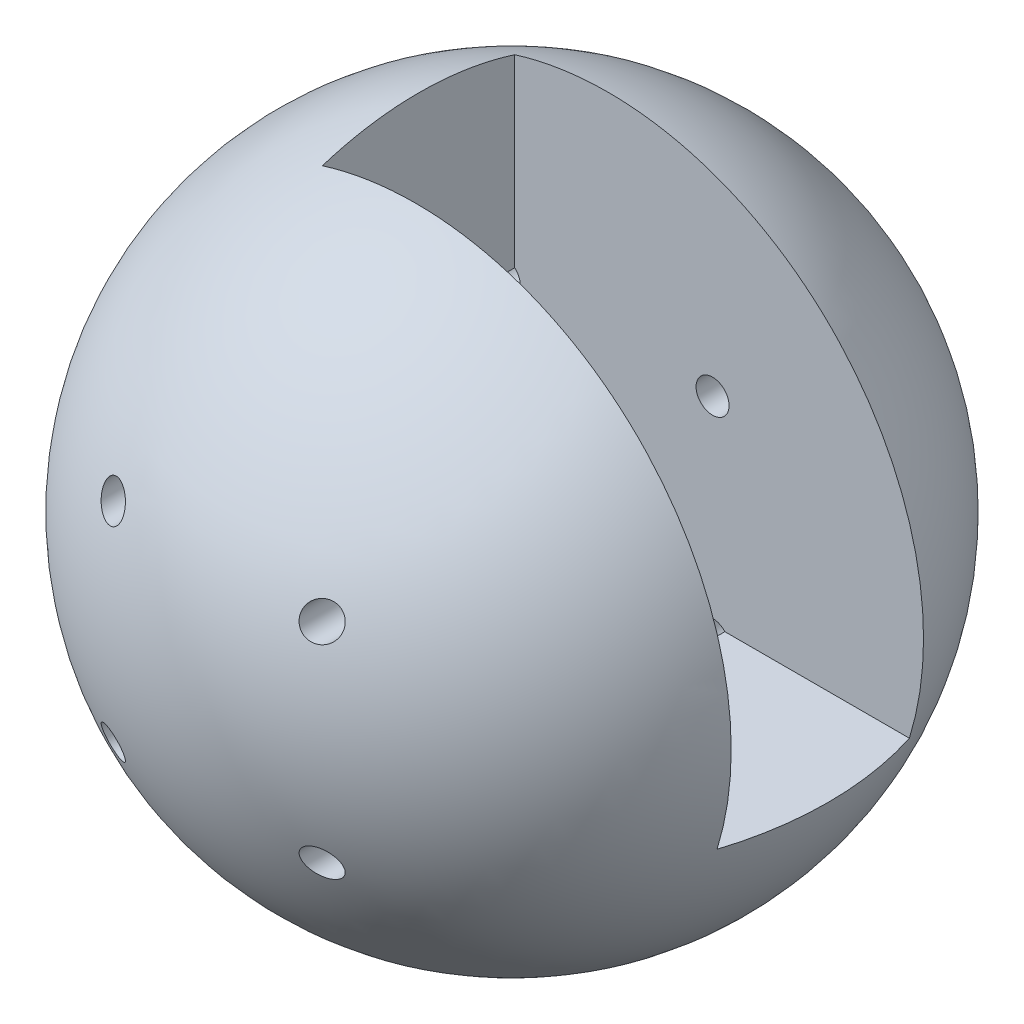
ISO-10303-21;
HEADER;
FILE_DESCRIPTION(('STEP AP214'),'2;1');
FILE_NAME('part.step','',(''),(''),'','','');
FILE_SCHEMA(('AUTOMOTIVE_DESIGN { 1 0 10303 214 1 1 1 1 }'));
ENDSEC;
DATA;
#1=APPLICATION_CONTEXT('core data for automotive mechanical design processes');
#2=APPLICATION_PROTOCOL_DEFINITION('international standard','automotive_design',2000,#1);
#3=PRODUCT_CONTEXT('',#1,'mechanical');
#4=PRODUCT('Part','Part','',(#3));
#5=PRODUCT_RELATED_PRODUCT_CATEGORY('part','',(#4));
#6=PRODUCT_DEFINITION_FORMATION('','',#4);
#7=PRODUCT_DEFINITION_CONTEXT('part definition',#1,'design');
#8=PRODUCT_DEFINITION('design','',#6,#7);
#9=PRODUCT_DEFINITION_SHAPE('','',#8);
#10=(LENGTH_UNIT() NAMED_UNIT(*) SI_UNIT(.MILLI.,.METRE.));
#11=(NAMED_UNIT(*) PLANE_ANGLE_UNIT() SI_UNIT($,.RADIAN.));
#12=(NAMED_UNIT(*) SI_UNIT($,.STERADIAN.) SOLID_ANGLE_UNIT());
#13=UNCERTAINTY_MEASURE_WITH_UNIT(LENGTH_MEASURE(1.E-05),#10,'distance_accuracy_value','');
#14=(GEOMETRIC_REPRESENTATION_CONTEXT(3) GLOBAL_UNCERTAINTY_ASSIGNED_CONTEXT((#13)) GLOBAL_UNIT_ASSIGNED_CONTEXT((#10,
#11,#12)) REPRESENTATION_CONTEXT('',''));
#15=CARTESIAN_POINT('',(0.,0.,0.));
#16=DIRECTION('',(0.,0.,1.));
#17=DIRECTION('',(1.,0.,0.));
#18=AXIS2_PLACEMENT_3D('',#15,#16,#17);
#19=CARTESIAN_POINT('',(-17.,-17.,-17.5));
#20=DIRECTION('',(0.,-1.,0.));
#21=DIRECTION('',(0.,0.,-1.));
#22=AXIS2_PLACEMENT_3D('',#19,#20,#21);
#23=PLANE('',#22);
#24=DIRECTION('',(1.,0.,0.));
#25=VECTOR('',#24,1.);
#26=CARTESIAN_POINT('',(-17.,-17.,-17.5));
#27=LINE('',#26,#25);
#28=CARTESIAN_POINT('',(21.2360679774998,-17.,-17.5));
#29=VERTEX_POINT('',#28);
#30=CARTESIAN_POINT('',(54.8155999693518,-17.,-17.5));
#31=VERTEX_POINT('',#30);
#32=EDGE_CURVE('E200',#29,#31,#27,.T.);
#33=ORIENTED_EDGE('',*,*,#32,.F.);
#34=DIRECTION('',(0.,0.,1.));
#35=VECTOR('',#34,1.);
#36=CARTESIAN_POINT('',(21.2360679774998,-17.,-60.));
#37=LINE('',#36,#35);
#38=CARTESIAN_POINT('',(21.2360679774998,-17.,17.5));
#39=VERTEX_POINT('',#38);
#40=EDGE_CURVE('E201',#29,#39,#37,.T.);
#41=ORIENTED_EDGE('',*,*,#40,.T.);
#42=DIRECTION('',(1.,0.,0.));
#43=VECTOR('',#42,1.);
#44=CARTESIAN_POINT('',(-17.,-17.,17.5));
#45=LINE('',#44,#43);
#46=CARTESIAN_POINT('',(54.8155999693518,-17.,17.5));
#47=VERTEX_POINT('',#46);
#48=EDGE_CURVE('E118',#39,#47,#45,.T.);
#49=ORIENTED_EDGE('',*,*,#48,.T.);
#50=CARTESIAN_POINT('',(0.,-17.,0.));
#51=DIRECTION('',(0.,-1.,0.));
#52=DIRECTION('',(0.,0.,-1.));
#53=AXIS2_PLACEMENT_3D('',#50,#51,#52);
#54=CIRCLE('',#53,57.5412895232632);
#55=EDGE_CURVE('E130',#31,#47,#54,.T.);
#56=ORIENTED_EDGE('',*,*,#55,.F.);
#57=EDGE_LOOP('',(#33,#41,#49,#56));
#58=FACE_BOUND('',#57,.T.);
#59=ADVANCED_FACE('F33',(#58),#23,.F.);
#60=CARTESIAN_POINT('',(-17.,-17.,-17.5));
#61=DIRECTION('',(-1.,0.,0.));
#62=DIRECTION('',(0.,0.,1.));
#63=AXIS2_PLACEMENT_3D('',#60,#61,#62);
#64=PLANE('',#63);
#65=DIRECTION('',(0.,-1.,0.));
#66=VECTOR('',#65,1.);
#67=CARTESIAN_POINT('',(-17.,-17.,17.5));
#68=LINE('',#67,#66);
#69=CARTESIAN_POINT('',(-17.,16.7639320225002,17.5));
#70=VERTEX_POINT('',#69);
#71=CARTESIAN_POINT('',(-17.,-16.7639320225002,17.5));
#72=VERTEX_POINT('',#71);
#73=EDGE_CURVE('E152',#70,#72,#68,.T.);
#74=ORIENTED_EDGE('',*,*,#73,.T.);
#75=DIRECTION('',(0.,0.,1.));
#76=VECTOR('',#75,1.);
#77=CARTESIAN_POINT('',(-17.,-16.7639320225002,-60.));
#78=LINE('',#77,#76);
#79=CARTESIAN_POINT('',(-17.,-16.7639320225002,-17.5));
#80=VERTEX_POINT('',#79);
#81=EDGE_CURVE('E50',#72,#80,#78,.F.);
#82=ORIENTED_EDGE('',*,*,#81,.T.);
#83=DIRECTION('',(0.,-1.,0.));
#84=VECTOR('',#83,1.);
#85=CARTESIAN_POINT('',(-17.,-17.,-17.5));
#86=LINE('',#85,#84);
#87=CARTESIAN_POINT('',(-17.,16.7639320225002,-17.5));
#88=VERTEX_POINT('',#87);
#89=EDGE_CURVE('E117',#88,#80,#86,.T.);
#90=ORIENTED_EDGE('',*,*,#89,.F.);
#91=DIRECTION('',(0.,0.,1.));
#92=VECTOR('',#91,1.);
#93=CARTESIAN_POINT('',(-17.,16.7639320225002,-60.));
#94=LINE('',#93,#92);
#95=EDGE_CURVE('E144',#88,#70,#94,.T.);
#96=ORIENTED_EDGE('',*,*,#95,.T.);
#97=EDGE_LOOP('',(#74,#82,#90,#96));
#98=FACE_BOUND('',#97,.T.);
#99=ADVANCED_FACE('F151',(#98),#64,.F.);
#100=CARTESIAN_POINT('',(0.,0.,0.));
#101=DIRECTION('',(0.,-1.,0.));
#102=DIRECTION('',(1.,0.,0.));
#103=AXIS2_PLACEMENT_3D('',#100,#101,#102);
#104=SPHERICAL_SURFACE('',#103,60.);
#105=CARTESIAN_POINT('',(16.8786796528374,16.8786796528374,-55.0474372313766));
#106=CARTESIAN_POINT('',(16.9889247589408,16.7684505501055,-55.0474318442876));
#107=CARTESIAN_POINT('',(17.1079010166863,16.6667371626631,-55.041474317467));
#108=CARTESIAN_POINT('',(17.3595540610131,16.4834044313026,-55.0178853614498));
#109=CARTESIAN_POINT('',(17.4922508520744,16.4018150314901,-55.0002366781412));
#110=CARTESIAN_POINT('',(17.766741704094,16.2608749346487,-54.9540816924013));
#111=CARTESIAN_POINT('',(17.9085110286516,16.2014665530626,-54.9256039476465));
#112=CARTESIAN_POINT('',(18.1972719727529,16.1053847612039,-54.8589113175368));
#113=CARTESIAN_POINT('',(18.344262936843,16.0687085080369,-54.8206976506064));
#114=CARTESIAN_POINT('',(18.6456035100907,16.0169304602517,-54.7341360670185));
#115=CARTESIAN_POINT('',(18.8000114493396,16.0027549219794,-54.6854425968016));
#116=CARTESIAN_POINT('',(19.1065780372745,15.9979722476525,-54.5804895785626));
#117=CARTESIAN_POINT('',(19.25873586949,16.0073734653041,-54.5242273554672));
#118=CARTESIAN_POINT('',(19.5719587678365,16.0503916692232,-54.3999531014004));
#119=CARTESIAN_POINT('',(19.7324733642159,16.0862503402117,-54.3313314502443));
#120=CARTESIAN_POINT('',(20.0434005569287,16.1825829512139,-54.1887231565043));
#121=CARTESIAN_POINT('',(20.193808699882,16.2430676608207,-54.1147341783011));
#122=CARTESIAN_POINT('',(20.4958879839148,16.3935579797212,-53.955611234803));
#123=CARTESIAN_POINT('',(20.6461989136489,16.4859001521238,-53.8701004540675));
#124=CARTESIAN_POINT('',(20.9276881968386,16.6946257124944,-53.6969233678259));
#125=CARTESIAN_POINT('',(21.0588590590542,16.8110184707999,-53.6092562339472));
#126=CARTESIAN_POINT('',(21.3070551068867,17.0732887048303,-53.4280419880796));
#127=CARTESIAN_POINT('',(21.4225537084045,17.2206147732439,-53.3344926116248));
#128=CARTESIAN_POINT('',(21.6248377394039,17.5353384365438,-53.1499936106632));
#129=CARTESIAN_POINT('',(21.7116170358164,17.7027403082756,-53.0590445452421));
#130=CARTESIAN_POINT('',(21.853088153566,18.0535894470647,-52.8824550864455));
#131=CARTESIAN_POINT('',(21.9077381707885,18.2370572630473,-52.7968217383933));
#132=CARTESIAN_POINT('',(21.9813667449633,18.6147078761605,-52.6341693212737));
#133=CARTESIAN_POINT('',(22.0003582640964,18.8088867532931,-52.5571471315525));
#134=CARTESIAN_POINT('',(21.999659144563,19.1872282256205,-52.4204407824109));
#135=CARTESIAN_POINT('',(21.982731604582,19.3710662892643,-52.3598946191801));
#136=CARTESIAN_POINT('',(21.9313877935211,19.6446780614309,-52.2791567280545));
#137=CARTESIAN_POINT('',(21.9099423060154,19.7355386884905,-52.2539211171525));
#138=CARTESIAN_POINT('',(21.8583624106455,19.915721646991,-52.2071388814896));
#139=CARTESIAN_POINT('',(21.8282292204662,20.0050441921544,-52.1855917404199));
#140=CARTESIAN_POINT('',(21.7329116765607,20.2485918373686,-52.1316033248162));
#141=CARTESIAN_POINT('',(21.6585310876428,20.400302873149,-52.103404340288));
#142=CARTESIAN_POINT('',(21.4842415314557,20.6903103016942,-52.0611898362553));
#143=CARTESIAN_POINT('',(21.3843512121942,20.8286163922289,-52.0471639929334));
#144=CARTESIAN_POINT('',(21.1727296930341,21.0743661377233,-52.0347036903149));
#145=CARTESIAN_POINT('',(21.0630280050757,21.1834939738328,-52.0349133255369));
#146=CARTESIAN_POINT('',(20.8285810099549,21.3832750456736,-52.0475696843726));
#147=CARTESIAN_POINT('',(20.7038385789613,21.4739318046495,-52.0600140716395));
#148=CARTESIAN_POINT('',(20.4463205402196,21.6325845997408,-52.0960834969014));
#149=CARTESIAN_POINT('',(20.3138033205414,21.7010640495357,-52.1194383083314));
#150=CARTESIAN_POINT('',(20.0419750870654,21.8171157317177,-52.1761952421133));
#151=CARTESIAN_POINT('',(19.9026630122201,21.8646846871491,-52.20959893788));
#152=CARTESIAN_POINT('',(19.613714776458,21.9405416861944,-52.2870904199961));
#153=CARTESIAN_POINT('',(19.4639135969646,21.967727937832,-52.3316346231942));
#154=CARTESIAN_POINT('',(19.1645511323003,21.9992672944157,-52.4287827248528));
#155=CARTESIAN_POINT('',(19.0149899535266,22.0036121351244,-52.4813895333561));
#156=CARTESIAN_POINT('',(18.7047787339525,21.9898576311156,-52.5985510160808));
#157=CARTESIAN_POINT('',(18.5444807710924,21.96951396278,-52.6637715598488));
#158=CARTESIAN_POINT('',(18.2315401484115,21.9043157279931,-52.8000201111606));
#159=CARTESIAN_POINT('',(18.0789009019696,21.8594503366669,-52.8710506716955));
#160=CARTESIAN_POINT('',(17.7683235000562,21.7410713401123,-53.0249896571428));
#161=CARTESIAN_POINT('',(17.6115868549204,21.6649915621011,-53.1083532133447));
#162=CARTESIAN_POINT('',(17.3145457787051,21.4878076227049,-53.2777416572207));
#163=CARTESIAN_POINT('',(17.1742483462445,21.3866928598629,-53.3637676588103));
#164=CARTESIAN_POINT('',(16.9032023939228,21.1535468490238,-53.5429934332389));
#165=CARTESIAN_POINT('',(16.7740013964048,21.0197442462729,-53.6362393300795));
#166=CARTESIAN_POINT('',(16.541912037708,20.7298334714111,-53.8208342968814));
#167=CARTESIAN_POINT('',(16.4390298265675,20.5737200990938,-53.9121829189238));
#168=CARTESIAN_POINT('',(16.2621767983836,20.2410252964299,-54.0914635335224));
#169=CARTESIAN_POINT('',(16.1885506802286,20.0642298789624,-54.1793443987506));
#170=CARTESIAN_POINT('',(16.1039343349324,19.788718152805,-54.3054416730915));
#171=CARTESIAN_POINT('',(16.0800269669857,19.6951095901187,-54.3465400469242));
#172=CARTESIAN_POINT('',(16.0412429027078,19.5051120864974,-54.4264650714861));
#173=CARTESIAN_POINT('',(16.026361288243,19.4087246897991,-54.4652929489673));
#174=CARTESIAN_POINT('',(16.0066649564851,19.2199726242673,-54.5379593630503));
#175=CARTESIAN_POINT('',(16.0012842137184,19.1277281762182,-54.5719579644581));
#176=CARTESIAN_POINT('',(15.9991236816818,18.9422331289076,-54.6372538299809));
#177=CARTESIAN_POINT('',(16.0023391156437,18.8489831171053,-54.668552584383));
#178=CARTESIAN_POINT('',(16.0176032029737,18.6622325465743,-54.7281200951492));
#179=CARTESIAN_POINT('',(16.0296517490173,18.5687319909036,-54.7563888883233));
#180=CARTESIAN_POINT('',(16.0627427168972,18.3823653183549,-54.8095484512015));
#181=CARTESIAN_POINT('',(16.0837837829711,18.2894991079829,-54.8344397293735));
#182=CARTESIAN_POINT('',(16.1321823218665,18.115177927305,-54.878053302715));
#183=CARTESIAN_POINT('',(16.158626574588,18.0335624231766,-54.8971504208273));
#184=CARTESIAN_POINT('',(16.2186828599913,17.872314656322,-54.9321618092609));
#185=CARTESIAN_POINT('',(16.2522938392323,17.7926821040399,-54.9480765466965));
#186=CARTESIAN_POINT('',(16.3264686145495,17.6362901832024,-54.9764983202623));
#187=CARTESIAN_POINT('',(16.3670181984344,17.5595253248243,-54.9890121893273));
#188=CARTESIAN_POINT('',(16.4548508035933,17.4094749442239,-55.0105056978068));
#189=CARTESIAN_POINT('',(16.5021306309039,17.3361877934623,-55.0194870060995));
#190=CARTESIAN_POINT('',(16.6012892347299,17.1963184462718,-55.0335439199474));
#191=CARTESIAN_POINT('',(16.6529437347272,17.1295903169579,-55.0387474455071));
#192=CARTESIAN_POINT('',(16.7617709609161,17.0006346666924,-55.0456955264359));
#193=CARTESIAN_POINT('',(16.8189435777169,16.9384070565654,-55.0474401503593));
#194=CARTESIAN_POINT('',(16.8786796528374,16.8786796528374,-55.0474372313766));
#195=B_SPLINE_CURVE_WITH_KNOTS('',3,(#105,#106,#107,#108,#109,#110,#111,#112,#113,#114,#115,
#116,#117,#118,#119,#120,#121,#122,#123,#124,#125,#126,#127,#128,#129,#130,#131,#132,#133,#134,
#135,#136,#137,#138,#139,#140,#141,#142,#143,#144,#145,#146,#147,#148,#149,#150,#151,#152,#153,
#154,#155,#156,#157,#158,#159,#160,#161,#162,#163,#164,#165,#166,#167,#168,#169,#170,#171,#172,
#173,#174,#175,#176,#177,#178,#179,#180,#181,#182,#183,#184,#185,#186,#187,#188,#189,#190,#191,
#192,#193,#194),.UNSPECIFIED.,.T.,.F.,(4,2,2,2,2,2,2,2,2,2,2,2,2,2,2,2,2,2,2,2,2,2,2,2,2,2,2,2,
2,2,2,2,2,2,2,2,2,2,2,2,2,2,2,2,4),(0.,0.467381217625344,0.935453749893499,1.40230037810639,
1.86908861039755,2.35463588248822,2.84035521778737,3.37278191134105,3.90544169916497,
4.49104167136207,5.07687023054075,5.7017643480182,6.32679182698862,6.95263075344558,
7.57824213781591,8.15747775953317,8.44718758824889,8.73685683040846,9.24768113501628,
9.75813308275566,10.2200404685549,10.6818596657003,11.1328022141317,11.5838154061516,
12.0577319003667,12.5318198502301,13.0524308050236,13.5732717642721,14.1502393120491,
14.7274516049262,15.3487456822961,15.9701848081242,16.5987428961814,16.9133505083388,
17.2277865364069,17.5227626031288,17.8175747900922,18.1123833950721,18.4071475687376,
18.6704683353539,18.9337504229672,19.1964995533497,19.4591244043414,19.712378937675,
19.9656284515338),.UNSPECIFIED.);
#196=CARTESIAN_POINT('',(16.8786796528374,16.8786796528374,-55.0474372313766));
#197=VERTEX_POINT('',#196);
#198=EDGE_CURVE('E209',#197,#197,#195,.T.);
#199=ORIENTED_EDGE('',*,*,#198,.T.);
#200=EDGE_LOOP('',(#199));
#201=FACE_BOUND('',#200,.T.);
#202=CARTESIAN_POINT('',(18.5375257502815,21.9641385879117,52.6681759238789));
#203=CARTESIAN_POINT('',(18.6975449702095,21.989102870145,52.6014432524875));
#204=CARTESIAN_POINT('',(18.8609756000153,22.0013121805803,52.5379535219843));
#205=CARTESIAN_POINT('',(19.1908276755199,21.9984641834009,52.4195614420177));
#206=CARTESIAN_POINT('',(19.3572500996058,21.9833977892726,52.3646619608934));
#207=CARTESIAN_POINT('',(19.689146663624,21.9246521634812,52.2654582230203));
#208=CARTESIAN_POINT('',(19.8546131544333,21.8808443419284,52.2212028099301));
#209=CARTESIAN_POINT('',(20.1782044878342,21.7642998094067,52.145817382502));
#210=CARTESIAN_POINT('',(20.336333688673,21.6915805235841,52.114679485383));
#211=CARTESIAN_POINT('',(20.6270578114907,21.5255550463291,52.0691961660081));
#212=CARTESIAN_POINT('',(20.7606834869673,21.4343672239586,52.0537044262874));
#213=CARTESIAN_POINT('',(21.0119878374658,21.231139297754,52.0361533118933));
#214=CARTESIAN_POINT('',(21.129673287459,21.119108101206,52.0340882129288));
#215=CARTESIAN_POINT('',(21.3380134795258,20.8858745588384,52.0431769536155));
#216=CARTESIAN_POINT('',(21.4299420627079,20.7657706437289,52.0534645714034));
#217=CARTESIAN_POINT('',(21.5941703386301,20.5142132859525,52.0853306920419));
#218=CARTESIAN_POINT('',(21.666470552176,20.3827601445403,52.1069088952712));
#219=CARTESIAN_POINT('',(21.7907001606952,20.1110902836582,52.1606430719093));
#220=CARTESIAN_POINT('',(21.8424307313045,19.9708025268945,52.1928970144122));
#221=CARTESIAN_POINT('',(21.9241681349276,19.6864052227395,52.2666200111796));
#222=CARTESIAN_POINT('',(21.954169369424,19.5422947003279,52.3080914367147));
#223=CARTESIAN_POINT('',(21.9942387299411,19.2429177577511,52.4021986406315));
#224=CARTESIAN_POINT('',(22.0026528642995,19.0876211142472,52.4554364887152));
#225=CARTESIAN_POINT('',(21.9958917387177,18.78023249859,52.5691022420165));
#226=CARTESIAN_POINT('',(21.9807068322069,18.628141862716,52.6295330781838));
#227=CARTESIAN_POINT('',(21.9253692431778,18.314254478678,52.7626684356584));
#228=CARTESIAN_POINT('',(21.882717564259,18.153161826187,52.8359943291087));
#229=CARTESIAN_POINT('',(21.7724563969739,17.8420919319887,52.9872899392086));
#230=CARTESIAN_POINT('',(21.7048357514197,17.6921196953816,53.0652617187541));
#231=CARTESIAN_POINT('',(21.5389995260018,17.3919836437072,53.2318535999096));
#232=CARTESIAN_POINT('',(21.4384075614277,17.2432883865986,53.3207607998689));
#233=CARTESIAN_POINT('',(21.2127742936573,16.9663940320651,53.4995290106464));
#234=CARTESIAN_POINT('',(21.0877239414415,16.8382025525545,53.5893903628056));
#235=CARTESIAN_POINT('',(20.8091589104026,16.5995183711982,53.7724749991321));
#236=CARTESIAN_POINT('',(20.6544955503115,16.4903061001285,53.8656275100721));
#237=CARTESIAN_POINT('',(20.3255062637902,16.3020467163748,54.0477685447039));
#238=CARTESIAN_POINT('',(20.1511788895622,16.2230018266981,54.1367567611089));
#239=CARTESIAN_POINT('',(19.7911918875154,16.100096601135,54.3059670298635));
#240=CARTESIAN_POINT('',(19.6058320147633,16.05555829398,54.3863297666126));
#241=CARTESIAN_POINT('',(19.2261815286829,16.0024089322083,54.5373199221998));
#242=CARTESIAN_POINT('',(19.0318957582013,15.9937786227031,54.6079525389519));
#243=CARTESIAN_POINT('',(18.6579265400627,16.0142192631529,54.7308132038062));
#244=CARTESIAN_POINT('',(18.4784357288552,16.0400897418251,54.7841054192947));
#245=CARTESIAN_POINT('',(18.2127649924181,16.1036941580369,54.854125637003));
#246=CARTESIAN_POINT('',(18.1247864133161,16.1290357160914,54.8758157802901));
#247=CARTESIAN_POINT('',(17.9508094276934,16.187948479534,54.9156407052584));
#248=CARTESIAN_POINT('',(17.8648107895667,16.2215187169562,54.9337759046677));
#249=CARTESIAN_POINT('',(17.6297872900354,16.3261337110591,54.9788672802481));
#250=CARTESIAN_POINT('',(17.4837696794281,16.4060166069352,55.0017125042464));
#251=CARTESIAN_POINT('',(17.2061220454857,16.5896669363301,55.0341738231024));
#252=CARTESIAN_POINT('',(17.0744839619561,16.6934208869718,55.0437973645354));
#253=CARTESIAN_POINT('',(16.8396116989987,16.9127709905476,55.0491549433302));
#254=CARTESIAN_POINT('',(16.7349709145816,17.0268401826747,55.0459013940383));
#255=CARTESIAN_POINT('',(16.5448490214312,17.2691214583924,55.0278947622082));
#256=CARTESIAN_POINT('',(16.4593654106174,17.3973316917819,55.0131431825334));
#257=CARTESIAN_POINT('',(16.3104295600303,17.6624373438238,54.9730065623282));
#258=CARTESIAN_POINT('',(16.2467380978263,17.7992175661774,54.9477442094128));
#259=CARTESIAN_POINT('',(16.1410044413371,18.0788573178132,54.8875774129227));
#260=CARTESIAN_POINT('',(16.0989659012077,18.2217178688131,54.8526713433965));
#261=CARTESIAN_POINT('',(16.0350408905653,18.5172581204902,54.7723865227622));
#262=CARTESIAN_POINT('',(16.014307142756,18.6700639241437,54.7265600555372));
#263=CARTESIAN_POINT('',(15.9962316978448,18.9744715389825,54.6270606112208));
#264=CARTESIAN_POINT('',(15.9988981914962,19.1260729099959,54.5733848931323));
#265=CARTESIAN_POINT('',(16.0277117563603,19.438551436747,54.4544382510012));
#266=CARTESIAN_POINT('',(16.0559985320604,19.5989971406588,54.3885547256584));
#267=CARTESIAN_POINT('',(16.1371065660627,19.9109603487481,54.251066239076));
#268=CARTESIAN_POINT('',(16.1899371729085,20.0624744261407,54.1794591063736));
#269=CARTESIAN_POINT('',(16.3244915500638,20.3683203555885,54.0248063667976));
#270=CARTESIAN_POINT('',(16.4085936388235,20.5213926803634,53.9413357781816));
#271=CARTESIAN_POINT('',(16.6010970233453,20.8097952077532,53.7716775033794));
#272=CARTESIAN_POINT('',(16.709513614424,20.9451141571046,53.6854881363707));
#273=CARTESIAN_POINT('',(16.9565378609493,21.2042295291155,53.5060694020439));
#274=CARTESIAN_POINT('',(17.0967861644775,21.3264318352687,53.4127911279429));
#275=CARTESIAN_POINT('',(17.3981286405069,21.5433092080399,53.228130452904));
#276=CARTESIAN_POINT('',(17.5592061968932,21.638006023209,53.1367466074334));
#277=CARTESIAN_POINT('',(17.855365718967,21.7765825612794,52.9810383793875));
#278=CARTESIAN_POINT('',(17.9867759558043,21.8272542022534,52.9156960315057));
#279=CARTESIAN_POINT('',(18.2570772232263,21.9099880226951,52.7887823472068));
#280=CARTESIAN_POINT('',(18.395966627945,21.9420542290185,52.7272101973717));
#281=CARTESIAN_POINT('',(18.5375257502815,21.9641385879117,52.6681759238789));
#282=B_SPLINE_CURVE_WITH_KNOTS('',3,(#202,#203,#204,#205,#206,#207,#208,#209,#210,#211,#212,
#213,#214,#215,#216,#217,#218,#219,#220,#221,#222,#223,#224,#225,#226,#227,#228,#229,#230,#231,
#232,#233,#234,#235,#236,#237,#238,#239,#240,#241,#242,#243,#244,#245,#246,#247,#248,#249,#250,
#251,#252,#253,#254,#255,#256,#257,#258,#259,#260,#261,#262,#263,#264,#265,#266,#267,#268,#269,
#270,#271,#272,#273,#274,#275,#276,#277,#278,#279,#280,#281),.UNSPECIFIED.,.T.,.F.,(4,2,2,2,2,2,
2,2,2,2,2,2,2,2,2,2,2,2,2,2,2,2,2,2,2,2,2,2,2,2,2,2,2,2,2,2,2,2,2,4),(0.,0.525012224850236,
1.05019938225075,1.57775241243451,2.10498796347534,2.58994632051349,3.07469790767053,
3.52735226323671,3.97999460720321,4.43691157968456,4.89394623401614,5.38507604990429,
5.87640667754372,6.4203390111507,6.96451469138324,7.56288826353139,8.16148363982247,
8.7914652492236,9.4214932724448,10.0388046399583,10.6557849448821,11.2193302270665,
11.5012069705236,11.7830505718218,12.2841209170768,12.7849089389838,13.2471371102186,
13.7093048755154,14.1662229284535,14.6232180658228,15.1038117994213,15.5845737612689,
16.1096089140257,16.6348442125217,17.2131004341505,17.7917214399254,18.413168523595,
19.0341228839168,19.4986693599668,19.9631152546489),.UNSPECIFIED.);
#283=CARTESIAN_POINT('',(18.5375257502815,21.9641385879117,52.6681759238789));
#284=VERTEX_POINT('',#283);
#285=EDGE_CURVE('E212',#284,#284,#282,.T.);
#286=ORIENTED_EDGE('',*,*,#285,.T.);
#287=EDGE_LOOP('',(#286));
#288=FACE_BOUND('',#287,.T.);
#289=CARTESIAN_POINT('',(16.0557682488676,-19.5757601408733,-54.3967086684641));
#290=CARTESIAN_POINT('',(16.0914877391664,-19.7583775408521,-54.320446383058));
#291=CARTESIAN_POINT('',(16.1439437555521,-19.9361758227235,-54.2398599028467));
#292=CARTESIAN_POINT('',(16.2792113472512,-20.2771478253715,-54.072778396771));
#293=CARTESIAN_POINT('',(16.3620983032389,-20.4402839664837,-53.9862691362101));
#294=CARTESIAN_POINT('',(16.5545936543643,-20.7471883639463,-53.8102220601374));
#295=CARTESIAN_POINT('',(16.6641144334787,-20.8910177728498,-53.7206949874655));
#296=CARTESIAN_POINT('',(16.9066428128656,-21.1564269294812,-53.5407456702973));
#297=CARTESIAN_POINT('',(17.0396404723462,-21.2780160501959,-53.4503238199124));
#298=CARTESIAN_POINT('',(17.3324159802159,-21.5009055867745,-53.2667117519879));
#299=CARTESIAN_POINT('',(17.4931438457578,-21.6010164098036,-53.1735853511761));
#300=CARTESIAN_POINT('',(17.8325363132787,-21.7700182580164,-52.9916145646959));
#301=CARTESIAN_POINT('',(18.0112051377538,-21.8389019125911,-52.9027711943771));
#302=CARTESIAN_POINT('',(18.3779036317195,-21.9408082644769,-52.7342003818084));
#303=CARTESIAN_POINT('',(18.5656533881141,-21.9745625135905,-52.6543192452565));
#304=CARTESIAN_POINT('',(18.8523173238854,-21.9979032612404,-52.5422975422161));
#305=CARTESIAN_POINT('',(18.9487542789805,-22.0011305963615,-52.5062431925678));
#306=CARTESIAN_POINT('',(19.142537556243,-21.9981748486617,-52.4371444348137));
#307=CARTESIAN_POINT('',(19.2398832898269,-21.9919974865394,-52.4040982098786));
#308=CARTESIAN_POINT('',(19.425659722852,-21.9709826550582,-52.3443253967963));
#309=CARTESIAN_POINT('',(19.514089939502,-21.9569906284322,-52.3172971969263));
#310=CARTESIAN_POINT('',(19.6901681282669,-21.9209139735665,-52.2664282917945));
#311=CARTESIAN_POINT('',(19.7778165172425,-21.8988339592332,-52.2425857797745));
#312=CARTESIAN_POINT('',(19.9515222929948,-21.846545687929,-52.1984090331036));
#313=CARTESIAN_POINT('',(20.0375804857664,-21.8163416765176,-52.1780729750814));
#314=CARTESIAN_POINT('',(20.2072445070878,-21.7478977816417,-52.1412018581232));
#315=CARTESIAN_POINT('',(20.2908506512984,-21.7096589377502,-52.124666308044));
#316=CARTESIAN_POINT('',(20.5173222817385,-21.5930798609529,-52.0845983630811));
#317=CARTESIAN_POINT('',(20.6567878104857,-21.5063882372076,-52.0653383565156));
#318=CARTESIAN_POINT('',(20.9203045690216,-21.3107073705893,-52.040577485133));
#319=CARTESIAN_POINT('',(21.0443643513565,-21.2017305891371,-52.0350689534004));
#320=CARTESIAN_POINT('',(21.2639824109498,-20.9741894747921,-52.0379617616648));
#321=CARTESIAN_POINT('',(21.3610029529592,-20.8570185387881,-52.0453202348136));
#322=CARTESIAN_POINT('',(21.5357225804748,-20.6102684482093,-52.0716094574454));
#323=CARTESIAN_POINT('',(21.613423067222,-20.4806901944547,-52.090539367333));
#324=CARTESIAN_POINT('',(21.7478917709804,-20.2130624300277,-52.1390863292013));
#325=CARTESIAN_POINT('',(21.8046661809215,-20.0750154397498,-52.1687002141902));
#326=CARTESIAN_POINT('',(21.8967317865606,-19.794225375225,-52.237388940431));
#327=CARTESIAN_POINT('',(21.932018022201,-19.6514812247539,-52.2764659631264));
#328=CARTESIAN_POINT('',(21.9829657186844,-19.3550301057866,-52.3656210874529));
#329=CARTESIAN_POINT('',(21.9971281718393,-19.201238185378,-52.4162668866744));
#330=CARTESIAN_POINT('',(22.0020844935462,-18.8959596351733,-52.5250157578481));
#331=CARTESIAN_POINT('',(21.9928690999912,-18.7444739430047,-52.5831217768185));
#332=CARTESIAN_POINT('',(21.9502619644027,-18.4312443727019,-52.7115480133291));
#333=CARTESIAN_POINT('',(21.9144309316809,-18.2700958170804,-52.7825101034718));
#334=CARTESIAN_POINT('',(21.8179183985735,-17.9578513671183,-52.9294450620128));
#335=CARTESIAN_POINT('',(21.7572257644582,-17.8067600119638,-53.0054201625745));
#336=CARTESIAN_POINT('',(21.6057203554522,-17.5026857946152,-53.1684856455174));
#337=CARTESIAN_POINT('',(21.5124527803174,-17.3511049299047,-53.2559158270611));
#338=CARTESIAN_POINT('',(21.3012270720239,-17.0672074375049,-53.4322681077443));
#339=CARTESIAN_POINT('',(21.1832593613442,-16.934898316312,-53.5211907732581));
#340=CARTESIAN_POINT('',(20.9178539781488,-16.6854920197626,-53.703646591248));
#341=CARTESIAN_POINT('',(20.7690705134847,-16.5697885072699,-53.7971353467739));
#342=CARTESIAN_POINT('',(20.450925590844,-16.3674429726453,-53.9806485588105));
#343=CARTESIAN_POINT('',(20.2815614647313,-16.2808047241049,-54.0706725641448));
#344=CARTESIAN_POINT('',(19.9285802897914,-16.1410882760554,-54.2435248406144));
#345=CARTESIAN_POINT('',(19.7451352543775,-16.0876606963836,-54.3264198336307));
#346=CARTESIAN_POINT('',(19.3676689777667,-16.0164367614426,-54.4831177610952));
#347=CARTESIAN_POINT('',(19.173652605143,-15.9986241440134,-54.5569248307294));
#348=CARTESIAN_POINT('',(18.79729963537,-16.0014258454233,-54.6868569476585));
#349=CARTESIAN_POINT('',(18.6152709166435,-16.0190789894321,-54.7439243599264));
#350=CARTESIAN_POINT('',(18.2541003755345,-16.0884106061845,-54.845119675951));
#351=CARTESIAN_POINT('',(18.0749561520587,-16.1400591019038,-54.8892589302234));
#352=CARTESIAN_POINT('',(17.7459993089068,-16.269575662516,-54.9582497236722));
#353=CARTESIAN_POINT('',(17.5951313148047,-16.3439218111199,-54.9846920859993));
#354=CARTESIAN_POINT('',(17.3067711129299,-16.5178108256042,-55.0242336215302));
#355=CARTESIAN_POINT('',(17.1692707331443,-16.617338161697,-55.0373409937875));
#356=CARTESIAN_POINT('',(16.9234712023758,-16.8292532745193,-55.0490372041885));
#357=CARTESIAN_POINT('',(16.8136916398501,-16.9398695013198,-55.0487485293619));
#358=CARTESIAN_POINT('',(16.6128702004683,-17.1763612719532,-55.0364355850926));
#359=CARTESIAN_POINT('',(16.5218239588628,-17.3022332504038,-55.0244140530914));
#360=CARTESIAN_POINT('',(16.3624054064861,-17.5626591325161,-54.989524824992));
#361=CARTESIAN_POINT('',(16.2936140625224,-17.6969876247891,-54.9668800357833));
#362=CARTESIAN_POINT('',(16.1774034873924,-17.9727005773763,-54.9117182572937));
#363=CARTESIAN_POINT('',(16.1299935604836,-18.1140880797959,-54.8791969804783));
#364=CARTESIAN_POINT('',(16.0552266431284,-18.4065939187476,-54.8037617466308));
#365=CARTESIAN_POINT('',(16.0288759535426,-18.5578628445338,-54.7604435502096));
#366=CARTESIAN_POINT('',(15.9994342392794,-18.8599680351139,-54.6657565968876));
#367=CARTESIAN_POINT('',(15.9963200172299,-19.010804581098,-54.6143959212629));
#368=CARTESIAN_POINT('',(16.008003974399,-19.2300833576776,-54.5339651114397));
#369=CARTESIAN_POINT('',(16.0142220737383,-19.3000287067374,-54.5074234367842));
#370=CARTESIAN_POINT('',(16.0314398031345,-19.4387930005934,-54.4530246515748));
#371=CARTESIAN_POINT('',(16.0424386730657,-19.5076121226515,-54.4251677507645));
#372=CARTESIAN_POINT('',(16.0557682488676,-19.5757601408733,-54.3967086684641));
#373=B_SPLINE_CURVE_WITH_KNOTS('',3,(#289,#290,#291,#292,#293,#294,#295,#296,#297,#298,#299,
#300,#301,#302,#303,#304,#305,#306,#307,#308,#309,#310,#311,#312,#313,#314,#315,#316,#317,#318,
#319,#320,#321,#322,#323,#324,#325,#326,#327,#328,#329,#330,#331,#332,#333,#334,#335,#336,#337,
#338,#339,#340,#341,#342,#343,#344,#345,#346,#347,#348,#349,#350,#351,#352,#353,#354,#355,#356,
#357,#358,#359,#360,#361,#362,#363,#364,#365,#366,#367,#368,#369,#370,#371,#372),.UNSPECIFIED.,
.T.,.F.,(4,2,2,2,2,2,2,2,2,2,2,2,2,2,2,2,2,2,2,2,2,2,2,2,2,2,2,2,2,2,2,2,2,2,2,2,2,2,2,2,2,4),
(0.,0.603007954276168,1.20751981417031,1.81006932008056,2.41236429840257,3.04234627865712,
3.672476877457,4.28920549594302,4.5978345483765,4.90627594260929,5.18645322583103,
5.46647092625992,5.74634257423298,6.02617803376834,6.51928986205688,7.01212670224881,
7.46684654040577,7.92153338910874,8.37608556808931,8.8307426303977,9.31634167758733,
9.80213314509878,10.3389845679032,10.8760766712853,11.4683769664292,12.0609073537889,
12.6890778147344,13.3173298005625,13.9388553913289,14.5600971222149,15.1316216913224,
15.7026429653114,16.2106572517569,16.7183589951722,17.1836026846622,17.6487378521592,
18.1045220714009,18.5605044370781,19.0371542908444,19.5133282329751,19.7383907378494,
19.963417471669),.UNSPECIFIED.);
#374=CARTESIAN_POINT('',(16.0557682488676,-19.5757601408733,-54.3967086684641));
#375=VERTEX_POINT('',#374);
#376=EDGE_CURVE('E238',#375,#375,#373,.T.);
#377=ORIENTED_EDGE('',*,*,#376,.T.);
#378=EDGE_LOOP('',(#377));
#379=FACE_BOUND('',#378,.T.);
#380=CARTESIAN_POINT('',(18.5375257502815,-21.9641385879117,52.6681759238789));
#381=CARTESIAN_POINT('',(18.3534882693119,-21.9354172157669,52.7449282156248));
#382=CARTESIAN_POINT('',(18.1736741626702,-21.8897614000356,52.8260966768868));
#383=CARTESIAN_POINT('',(17.8275094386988,-21.7675112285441,52.9943046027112));
#384=CARTESIAN_POINT('',(17.661194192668,-21.6908385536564,53.0813584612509));
#385=CARTESIAN_POINT('',(17.3468636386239,-21.5099577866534,53.2583193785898));
#386=CARTESIAN_POINT('',(17.1987908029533,-21.4058396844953,53.3482162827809));
#387=CARTESIAN_POINT('',(16.9239693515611,-21.1731352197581,53.5286667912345));
#388=CARTESIAN_POINT('',(16.7972112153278,-21.0445598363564,53.6192200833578));
#389=CARTESIAN_POINT('',(16.563117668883,-20.7598476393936,53.8027518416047));
#390=CARTESIAN_POINT('',(16.4569090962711,-20.6027329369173,53.8956567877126));
#391=CARTESIAN_POINT('',(16.2751026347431,-20.2692523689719,54.077007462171));
#392=CARTESIAN_POINT('',(16.199510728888,-20.0928827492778,54.1654523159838));
#393=CARTESIAN_POINT('',(16.08414848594,-19.7301561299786,54.3328930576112));
#394=CARTESIAN_POINT('',(16.0435509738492,-19.5441467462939,54.4120665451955));
#395=CARTESIAN_POINT('',(15.99837567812,-19.1639224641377,54.5604084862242));
#396=CARTESIAN_POINT('',(15.9937767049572,-18.9697124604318,54.6295828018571));
#397=CARTESIAN_POINT('',(16.0218485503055,-18.5971872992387,54.7492457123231));
#398=CARTESIAN_POINT('',(16.0512288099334,-18.4190009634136,54.8008511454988));
#399=CARTESIAN_POINT('',(16.1197979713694,-18.1557895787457,54.8682802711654));
#400=CARTESIAN_POINT('',(16.1467446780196,-18.0687148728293,54.8890963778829));
#401=CARTESIAN_POINT('',(16.2087458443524,-17.8967058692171,54.9271626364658));
#402=CARTESIAN_POINT('',(16.2437993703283,-17.8117713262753,54.9444131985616));
#403=CARTESIAN_POINT('',(16.3523658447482,-17.579845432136,54.9870596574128));
#404=CARTESIAN_POINT('',(16.4345723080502,-17.4360294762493,55.0083388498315));
#405=CARTESIAN_POINT('',(16.6223029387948,-17.1631591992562,55.0377385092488));
#406=CARTESIAN_POINT('',(16.7278145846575,-17.0340970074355,55.0458660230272));
#407=CARTESIAN_POINT('',(16.9502821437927,-16.8040162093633,55.0484937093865));
#408=CARTESIAN_POINT('',(17.0658159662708,-16.7016299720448,55.0439566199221));
#409=CARTESIAN_POINT('',(17.3105433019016,-16.5161918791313,55.023487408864));
#410=CARTESIAN_POINT('',(17.4397352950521,-16.4331378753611,55.0075565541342));
#411=CARTESIAN_POINT('',(17.7068193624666,-16.2888084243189,54.9651397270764));
#412=CARTESIAN_POINT('',(17.8446380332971,-16.2273726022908,54.9387347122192));
#413=CARTESIAN_POINT('',(18.1259485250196,-16.1262585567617,54.8763801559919));
#414=CARTESIAN_POINT('',(18.2694413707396,-16.0865842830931,54.8404288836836));
#415=CARTESIAN_POINT('',(18.5663044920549,-16.0274513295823,54.758004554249));
#416=CARTESIAN_POINT('',(18.7197866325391,-16.0092132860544,54.7110645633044));
#417=CARTESIAN_POINT('',(19.02514455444,-15.996210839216,54.6094412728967));
#418=CARTESIAN_POINT('',(19.177019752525,-16.0014546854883,54.5547552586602));
#419=CARTESIAN_POINT('',(19.489875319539,-16.035706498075,54.4337384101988));
#420=CARTESIAN_POINT('',(19.6503805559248,-16.0668890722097,54.3667969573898));
#421=CARTESIAN_POINT('',(19.9620176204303,-16.1538227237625,54.2273264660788));
#422=CARTESIAN_POINT('',(20.1131454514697,-16.2095841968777,54.1547950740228));
#423=CARTESIAN_POINT('',(20.4176524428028,-16.3502579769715,53.9983898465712));
#424=CARTESIAN_POINT('',(20.5697310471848,-16.4375369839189,53.9141087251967));
#425=CARTESIAN_POINT('',(20.8555900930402,-16.6362905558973,53.7430540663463));
#426=CARTESIAN_POINT('',(20.9893631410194,-16.7477748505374,53.6562795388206));
#427=CARTESIAN_POINT('',(21.2443584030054,-17.0006664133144,53.4761416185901));
#428=CARTESIAN_POINT('',(21.3640150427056,-17.143636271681,53.3827478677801));
#429=CARTESIAN_POINT('',(21.5754163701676,-17.4501903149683,53.1980777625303));
#430=CARTESIAN_POINT('',(21.6671543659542,-17.6137794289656,53.1068019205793));
#431=CARTESIAN_POINT('',(21.8198913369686,-17.9588080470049,52.9284180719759));
#432=CARTESIAN_POINT('',(21.8806415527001,-18.1403784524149,52.841348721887));
#433=CARTESIAN_POINT('',(21.9668226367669,-18.5153140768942,52.6752854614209));
#434=CARTESIAN_POINT('',(21.9922639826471,-18.7086757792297,52.5962891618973));
#435=CARTESIAN_POINT('',(22.0042929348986,-19.0876508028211,52.4548454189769));
#436=CARTESIAN_POINT('',(21.9934098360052,-19.272894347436,52.391637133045));
#437=CARTESIAN_POINT('',(21.9364279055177,-19.6419960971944,52.2783234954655));
#438=CARTESIAN_POINT('',(21.8903627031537,-19.8258554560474,52.2282056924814));
#439=CARTESIAN_POINT('',(21.7701372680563,-20.1639232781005,52.1488935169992));
#440=CARTESIAN_POINT('',(21.6998509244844,-20.3190989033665,52.1179476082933));
#441=CARTESIAN_POINT('',(21.5327654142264,-20.6168381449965,52.0702952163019));
#442=CARTESIAN_POINT('',(21.4359867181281,-20.7594113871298,52.0535777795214));
#443=CARTESIAN_POINT('',(21.2297016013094,-21.0130729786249,52.0362818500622));
#444=CARTESIAN_POINT('',(21.1224225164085,-21.1258828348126,52.03426192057));
#445=CARTESIAN_POINT('',(20.8919913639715,-21.3333190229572,52.0426577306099));
#446=CARTESIAN_POINT('',(20.7688438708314,-21.4279505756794,52.0530698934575));
#447=CARTESIAN_POINT('',(20.5145754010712,-21.5939194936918,52.0852900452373));
#448=CARTESIAN_POINT('',(20.3838149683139,-21.6658824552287,52.1067386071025));
#449=CARTESIAN_POINT('',(20.1148105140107,-21.7891034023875,52.1598693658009));
#450=CARTESIAN_POINT('',(19.9765633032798,-21.8403524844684,52.1915559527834));
#451=CARTESIAN_POINT('',(19.6899116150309,-21.9235790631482,52.2655601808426));
#452=CARTESIAN_POINT('',(19.5413315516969,-21.9545700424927,52.3082970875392));
#453=CARTESIAN_POINT('',(19.243932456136,-21.9938213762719,52.4019802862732));
#454=CARTESIAN_POINT('',(19.0951137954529,-22.002103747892,52.4529185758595));
#455=CARTESIAN_POINT('',(18.8786098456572,-21.9983444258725,52.5326221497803));
#456=CARTESIAN_POINT('',(18.8097209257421,-21.9947470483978,52.5588330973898));
#457=CARTESIAN_POINT('',(18.6728745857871,-21.9829023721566,52.6125574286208));
#458=CARTESIAN_POINT('',(18.6049170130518,-21.9746558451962,52.6400705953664));
#459=CARTESIAN_POINT('',(18.5375257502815,-21.9641385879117,52.6681759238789));
#460=B_SPLINE_CURVE_WITH_KNOTS('',3,(#380,#381,#382,#383,#384,#385,#386,#387,#388,#389,#390,
#391,#392,#393,#394,#395,#396,#397,#398,#399,#400,#401,#402,#403,#404,#405,#406,#407,#408,#409,
#410,#411,#412,#413,#414,#415,#416,#417,#418,#419,#420,#421,#422,#423,#424,#425,#426,#427,#428,
#429,#430,#431,#432,#433,#434,#435,#436,#437,#438,#439,#440,#441,#442,#443,#444,#445,#446,#447,
#448,#449,#450,#451,#452,#453,#454,#455,#456,#457,#458,#459),.UNSPECIFIED.,.T.,.F.,(4,2,2,2,2,2,
2,2,2,2,2,2,2,2,2,2,2,2,2,2,2,2,2,2,2,2,2,2,2,2,2,2,2,2,2,2,2,2,2,4),(0.,0.604091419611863,
1.20971781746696,1.81338262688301,2.41677708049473,3.04724849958,3.67784306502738,
4.29308775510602,4.90797027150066,5.46795995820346,5.74805756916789,6.02812293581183,
6.52626307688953,7.02413622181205,7.48521399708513,7.94624051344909,8.40377098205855,
8.8613844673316,9.34395735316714,9.82669978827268,10.354546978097,10.8826176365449,
11.4637666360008,12.0451496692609,12.6678130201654,13.290625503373,13.9183619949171,
14.545912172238,15.1307023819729,15.7149343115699,16.2314704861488,16.7476086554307,
17.2123460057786,17.6769496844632,18.1272992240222,18.5778421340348,19.0489517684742,
19.5196044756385,19.7408487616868,19.962056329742),.UNSPECIFIED.);
#461=CARTESIAN_POINT('',(18.5375257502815,-21.9641385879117,52.6681759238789));
#462=VERTEX_POINT('',#461);
#463=EDGE_CURVE('E233',#462,#462,#460,.T.);
#464=ORIENTED_EDGE('',*,*,#463,.T.);
#465=EDGE_LOOP('',(#464));
#466=FACE_BOUND('',#465,.T.);
#467=CARTESIAN_POINT('',(-21.1213203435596,-21.1213203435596,-52.036330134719));
#468=CARTESIAN_POINT('',(-21.0118207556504,-21.2308036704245,-52.03633623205));
#469=CARTESIAN_POINT('',(-20.8937044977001,-21.3318867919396,-52.0425565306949));
#470=CARTESIAN_POINT('',(-20.644018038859,-21.5141961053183,-52.0671490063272));
#471=CARTESIAN_POINT('',(-20.5124279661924,-21.595392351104,-52.0855393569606));
#472=CARTESIAN_POINT('',(-20.2404308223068,-21.7358147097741,-52.1335135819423));
#473=CARTESIAN_POINT('',(-20.1000504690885,-21.7951039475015,-52.1630647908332));
#474=CARTESIAN_POINT('',(-19.8142497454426,-21.8913232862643,-52.2320726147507));
#475=CARTESIAN_POINT('',(-19.6688298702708,-21.9282555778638,-52.2715282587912));
#476=CARTESIAN_POINT('',(-19.3700323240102,-21.9811276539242,-52.360844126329));
#477=CARTESIAN_POINT('',(-19.216591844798,-21.9960441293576,-52.4110937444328));
#478=CARTESIAN_POINT('',(-18.9118898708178,-22.0025800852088,-52.5190732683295));
#479=CARTESIAN_POINT('',(-18.7606292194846,-21.9941907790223,-52.5768059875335));
#480=CARTESIAN_POINT('',(-18.4476422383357,-21.9533646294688,-52.7045180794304));
#481=CARTESIAN_POINT('',(-18.2865008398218,-21.9184784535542,-52.7751469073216));
#482=CARTESIAN_POINT('',(-17.9741219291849,-21.8238700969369,-52.9214669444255));
#483=CARTESIAN_POINT('',(-17.8228890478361,-21.7641363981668,-52.9971604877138));
#484=CARTESIAN_POINT('',(-17.5183140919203,-21.6146249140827,-53.1597175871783));
#485=CARTESIAN_POINT('',(-17.3663630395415,-21.5223839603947,-53.2469280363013));
#486=CARTESIAN_POINT('',(-17.0815546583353,-21.3131833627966,-53.4229137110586));
#487=CARTESIAN_POINT('',(-16.9487046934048,-21.1962142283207,-53.5116895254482));
#488=CARTESIAN_POINT('',(-16.6978700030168,-20.9326843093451,-53.694019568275));
#489=CARTESIAN_POINT('',(-16.5812925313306,-20.7847506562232,-53.7875337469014));
#490=CARTESIAN_POINT('',(-16.3770402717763,-20.4681852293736,-53.9711948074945));
#491=CARTESIAN_POINT('',(-16.2893694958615,-20.2995505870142,-54.0613412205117));
#492=CARTESIAN_POINT('',(-16.1473428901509,-19.9476330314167,-54.23466011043));
#493=CARTESIAN_POINT('',(-16.0926823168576,-19.7645023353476,-54.317890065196));
#494=CARTESIAN_POINT('',(-16.0189377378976,-19.3874445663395,-54.4753492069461));
#495=CARTESIAN_POINT('',(-15.999837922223,-19.1935223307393,-54.5495823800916));
#496=CARTESIAN_POINT('',(-16.0001513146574,-18.8169158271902,-54.6804846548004));
#497=CARTESIAN_POINT('',(-16.0166392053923,-18.6345551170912,-54.73807835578));
#498=CARTESIAN_POINT('',(-16.0837455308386,-18.2724948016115,-54.8403637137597));
#499=CARTESIAN_POINT('',(-16.1343339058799,-18.0927929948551,-54.8850666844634));
#500=CARTESIAN_POINT('',(-16.2620085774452,-17.7625760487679,-54.9551351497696));
#501=CARTESIAN_POINT('',(-16.3355567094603,-17.6110278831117,-54.9820897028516));
#502=CARTESIAN_POINT('',(-16.5080284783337,-17.3211738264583,-55.0226383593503));
#503=CARTESIAN_POINT('',(-16.6069361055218,-17.1828596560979,-55.0362408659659));
#504=CARTESIAN_POINT('',(-16.8177656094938,-16.9355368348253,-55.0488377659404));
#505=CARTESIAN_POINT('',(-16.9278804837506,-16.8250392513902,-55.0489698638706));
#506=CARTESIAN_POINT('',(-17.1635343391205,-16.6227127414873,-55.03746582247));
#507=CARTESIAN_POINT('',(-17.2890704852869,-16.5308803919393,-55.0258318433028));
#508=CARTESIAN_POINT('',(-17.5488500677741,-16.369976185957,-54.9916801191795));
#509=CARTESIAN_POINT('',(-17.6828525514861,-16.3004631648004,-54.9693982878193));
#510=CARTESIAN_POINT('',(-17.9580011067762,-16.1827960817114,-54.9149382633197));
#511=CARTESIAN_POINT('',(-18.0991481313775,-16.1346448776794,-54.8827587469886));
#512=CARTESIAN_POINT('',(-18.391088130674,-16.0584062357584,-54.8080346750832));
#513=CARTESIAN_POINT('',(-18.5420328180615,-16.0312899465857,-54.7650978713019));
#514=CARTESIAN_POINT('',(-18.8437522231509,-16.000231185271,-54.6711151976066));
#515=CARTESIAN_POINT('',(-18.994526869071,-15.9962962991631,-54.6200666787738));
#516=CARTESIAN_POINT('',(-19.3057016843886,-16.0112055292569,-54.506522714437));
#517=CARTESIAN_POINT('',(-19.4657796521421,-16.0320869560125,-54.4434150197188));
#518=CARTESIAN_POINT('',(-19.778168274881,-16.0982798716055,-54.3111346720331));
#519=CARTESIAN_POINT('',(-19.9304756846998,-16.1436014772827,-54.2419595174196));
#520=CARTESIAN_POINT('',(-20.2393123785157,-16.2624486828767,-54.0919518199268));
#521=CARTESIAN_POINT('',(-20.3946898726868,-16.3383780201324,-54.0106497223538));
#522=CARTESIAN_POINT('',(-20.6889945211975,-16.5146917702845,-53.8448400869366));
#523=CARTESIAN_POINT('',(-20.8279147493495,-16.6150864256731,-53.76033121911));
#524=CARTESIAN_POINT('',(-21.096658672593,-16.8464219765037,-53.5833123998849));
#525=CARTESIAN_POINT('',(-21.2248740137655,-16.9791601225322,-53.490701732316));
#526=CARTESIAN_POINT('',(-21.4552445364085,-17.2663105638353,-53.3065604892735));
#527=CARTESIAN_POINT('',(-21.5573922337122,-17.4207290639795,-53.2150302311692));
#528=CARTESIAN_POINT('',(-21.7342362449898,-17.7510764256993,-53.0336357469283));
#529=CARTESIAN_POINT('',(-21.8082689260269,-17.927408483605,-52.9438543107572));
#530=CARTESIAN_POINT('',(-21.9220562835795,-18.2940041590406,-52.7711773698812));
#531=CARTESIAN_POINT('',(-21.9618175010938,-18.4842651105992,-52.6882805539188));
#532=CARTESIAN_POINT('',(-22.0025475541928,-18.8626874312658,-52.5369059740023));
#533=CARTESIAN_POINT('',(-22.0054977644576,-19.0504060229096,-52.4678909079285));
#534=CARTESIAN_POINT('',(-21.9829943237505,-19.3327186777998,-52.3736947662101));
#535=CARTESIAN_POINT('',(-21.9709954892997,-19.426980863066,-52.3438410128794));
#536=CARTESIAN_POINT('',(-21.9378419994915,-19.6149594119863,-52.2876116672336));
#537=CARTESIAN_POINT('',(-21.9166888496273,-19.7086758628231,-52.2612355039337));
#538=CARTESIAN_POINT('',(-21.8679903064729,-19.8843083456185,-52.215066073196));
#539=CARTESIAN_POINT('',(-21.8414068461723,-19.9663861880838,-52.1948676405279));
#540=CARTESIAN_POINT('',(-21.780965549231,-20.1285908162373,-52.1578105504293));
#541=CARTESIAN_POINT('',(-21.7471089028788,-20.2087179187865,-52.140951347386));
#542=CARTESIAN_POINT('',(-21.6723306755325,-20.3660975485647,-52.1108429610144));
#543=CARTESIAN_POINT('',(-21.631424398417,-20.4433558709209,-52.0975861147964));
#544=CARTESIAN_POINT('',(-21.5427620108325,-20.5943727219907,-52.0748404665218));
#545=CARTESIAN_POINT('',(-21.495009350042,-20.6681329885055,-52.0653497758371));
#546=CARTESIAN_POINT('',(-21.3957639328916,-20.8075482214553,-52.0506886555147));
#547=CARTESIAN_POINT('',(-21.3446146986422,-20.8734258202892,-52.045311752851));
#548=CARTESIAN_POINT('',(-21.2369190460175,-21.0007900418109,-52.0381308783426));
#549=CARTESIAN_POINT('',(-21.1803727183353,-21.0622767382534,-52.0363268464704));
#550=CARTESIAN_POINT('',(-21.1213203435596,-21.1213203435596,-52.036330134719));
#551=B_SPLINE_CURVE_WITH_KNOTS('',3,(#467,#468,#469,#470,#471,#472,#473,#474,#475,#476,#477,
#478,#479,#480,#481,#482,#483,#484,#485,#486,#487,#488,#489,#490,#491,#492,#493,#494,#495,#496,
#497,#498,#499,#500,#501,#502,#503,#504,#505,#506,#507,#508,#509,#510,#511,#512,#513,#514,#515,
#516,#517,#518,#519,#520,#521,#522,#523,#524,#525,#526,#527,#528,#529,#530,#531,#532,#533,#534,
#535,#536,#537,#538,#539,#540,#541,#542,#543,#544,#545,#546,#547,#548,#549,#550),.UNSPECIFIED.,
.T.,.F.,(4,2,2,2,2,2,2,2,2,2,2,2,2,2,2,2,2,2,2,2,2,2,2,2,2,2,2,2,2,2,2,2,2,2,2,2,2,2,2,2,2,4),
(0.,0.46421853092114,0.929131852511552,1.39269488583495,1.85621249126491,2.34066191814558,
2.82529401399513,3.3611786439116,3.89731196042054,4.48873783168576,5.08039110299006,
5.70825202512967,6.33620005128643,6.95825865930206,7.5800406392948,8.1526669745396,
8.72478919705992,9.23380662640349,9.74250349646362,10.2081971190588,10.6738052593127,
11.1295445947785,11.5853448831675,12.0611088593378,12.5370285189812,13.0548754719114,
13.5729369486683,14.1437985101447,14.7148994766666,15.3315341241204,15.9483456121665,
16.5789249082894,17.2093838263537,17.8057517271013,18.104159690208,18.4025185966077,
18.6679815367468,18.9334010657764,19.1982514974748,19.4629689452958,19.713323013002,
19.9636728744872),.UNSPECIFIED.);
#552=CARTESIAN_POINT('',(-21.1213203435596,-21.1213203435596,-52.036330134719));
#553=VERTEX_POINT('',#552);
#554=EDGE_CURVE('E262',#553,#553,#551,.T.);
#555=ORIENTED_EDGE('',*,*,#554,.T.);
#556=EDGE_LOOP('',(#555));
#557=FACE_BOUND('',#556,.T.);
#558=CARTESIAN_POINT('',(-21.1213203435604,-21.1213203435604,52.0363301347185));
#559=CARTESIAN_POINT('',(-21.2308036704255,-21.0118207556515,52.0363362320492));
#560=CARTESIAN_POINT('',(-21.3318867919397,-20.8937044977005,52.0425565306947));
#561=CARTESIAN_POINT('',(-21.5141961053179,-20.6440180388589,52.0671490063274));
#562=CARTESIAN_POINT('',(-21.5953923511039,-20.5124279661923,52.0855393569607));
#563=CARTESIAN_POINT('',(-21.7358147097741,-20.2404308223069,52.1335135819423));
#564=CARTESIAN_POINT('',(-21.7951039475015,-20.1000504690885,52.1630647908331));
#565=CARTESIAN_POINT('',(-21.8913232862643,-19.8142497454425,52.2320726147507));
#566=CARTESIAN_POINT('',(-21.9282555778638,-19.6688298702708,52.2715282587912));
#567=CARTESIAN_POINT('',(-21.9811276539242,-19.3700323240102,52.360844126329));
#568=CARTESIAN_POINT('',(-21.9960441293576,-19.216591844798,52.4110937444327));
#569=CARTESIAN_POINT('',(-22.0025800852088,-18.9118898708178,52.5190732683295));
#570=CARTESIAN_POINT('',(-21.9941907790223,-18.7606292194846,52.5768059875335));
#571=CARTESIAN_POINT('',(-21.9533646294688,-18.4476422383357,52.7045180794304));
#572=CARTESIAN_POINT('',(-21.9184784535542,-18.2865008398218,52.7751469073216));
#573=CARTESIAN_POINT('',(-21.8238700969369,-17.9741219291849,52.9214669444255));
#574=CARTESIAN_POINT('',(-21.7641363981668,-17.8228890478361,52.9971604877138));
#575=CARTESIAN_POINT('',(-21.6146249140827,-17.5183140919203,53.1597175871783));
#576=CARTESIAN_POINT('',(-21.5223839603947,-17.3663630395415,53.2469280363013));
#577=CARTESIAN_POINT('',(-21.3131833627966,-17.0815546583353,53.4229137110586));
#578=CARTESIAN_POINT('',(-21.1962142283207,-16.9487046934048,53.5116895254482));
#579=CARTESIAN_POINT('',(-20.9326843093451,-16.6978700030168,53.694019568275));
#580=CARTESIAN_POINT('',(-20.7847506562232,-16.5812925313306,53.7875337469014));
#581=CARTESIAN_POINT('',(-20.4681852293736,-16.3770402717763,53.9711948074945));
#582=CARTESIAN_POINT('',(-20.2995505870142,-16.2893694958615,54.0613412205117));
#583=CARTESIAN_POINT('',(-19.9476330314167,-16.1473428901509,54.23466011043));
#584=CARTESIAN_POINT('',(-19.7645023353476,-16.0926823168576,54.317890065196));
#585=CARTESIAN_POINT('',(-19.3874445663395,-16.0189377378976,54.4753492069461));
#586=CARTESIAN_POINT('',(-19.1935223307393,-15.999837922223,54.5495823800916));
#587=CARTESIAN_POINT('',(-18.8169158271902,-16.0001513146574,54.6804846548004));
#588=CARTESIAN_POINT('',(-18.6345551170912,-16.0166392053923,54.73807835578));
#589=CARTESIAN_POINT('',(-18.2724948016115,-16.0837455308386,54.8403637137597));
#590=CARTESIAN_POINT('',(-18.0927929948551,-16.1343339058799,54.8850666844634));
#591=CARTESIAN_POINT('',(-17.7625760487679,-16.2620085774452,54.9551351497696));
#592=CARTESIAN_POINT('',(-17.6110278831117,-16.3355567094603,54.9820897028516));
#593=CARTESIAN_POINT('',(-17.3211738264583,-16.5080284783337,55.0226383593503));
#594=CARTESIAN_POINT('',(-17.1828596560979,-16.6069361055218,55.0362408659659));
#595=CARTESIAN_POINT('',(-16.9355368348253,-16.8177656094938,55.0488377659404));
#596=CARTESIAN_POINT('',(-16.8250392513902,-16.9278804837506,55.0489698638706));
#597=CARTESIAN_POINT('',(-16.6227127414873,-17.1635343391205,55.03746582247));
#598=CARTESIAN_POINT('',(-16.5308803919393,-17.2890704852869,55.0258318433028));
#599=CARTESIAN_POINT('',(-16.369976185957,-17.5488500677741,54.9916801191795));
#600=CARTESIAN_POINT('',(-16.3004631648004,-17.6828525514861,54.9693982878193));
#601=CARTESIAN_POINT('',(-16.1827960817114,-17.9580011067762,54.9149382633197));
#602=CARTESIAN_POINT('',(-16.1346448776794,-18.0991481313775,54.8827587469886));
#603=CARTESIAN_POINT('',(-16.0584062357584,-18.391088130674,54.8080346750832));
#604=CARTESIAN_POINT('',(-16.0312899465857,-18.5420328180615,54.7650978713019));
#605=CARTESIAN_POINT('',(-16.000231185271,-18.8437522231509,54.6711151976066));
#606=CARTESIAN_POINT('',(-15.9962962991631,-18.994526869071,54.6200666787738));
#607=CARTESIAN_POINT('',(-16.0112055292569,-19.3057016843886,54.506522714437));
#608=CARTESIAN_POINT('',(-16.0320869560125,-19.4657796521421,54.4434150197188));
#609=CARTESIAN_POINT('',(-16.0982798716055,-19.778168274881,54.3111346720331));
#610=CARTESIAN_POINT('',(-16.1436014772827,-19.9304756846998,54.2419595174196));
#611=CARTESIAN_POINT('',(-16.2624486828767,-20.2393123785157,54.0919518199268));
#612=CARTESIAN_POINT('',(-16.3383780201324,-20.3946898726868,54.0106497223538));
#613=CARTESIAN_POINT('',(-16.5146917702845,-20.6889945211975,53.8448400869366));
#614=CARTESIAN_POINT('',(-16.6150864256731,-20.8279147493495,53.76033121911));
#615=CARTESIAN_POINT('',(-16.8464219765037,-21.096658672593,53.5833123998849));
#616=CARTESIAN_POINT('',(-16.9791601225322,-21.2248740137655,53.490701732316));
#617=CARTESIAN_POINT('',(-17.2663105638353,-21.4552445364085,53.3065604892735));
#618=CARTESIAN_POINT('',(-17.4207290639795,-21.5573922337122,53.2150302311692));
#619=CARTESIAN_POINT('',(-17.7510764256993,-21.7342362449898,53.0336357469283));
#620=CARTESIAN_POINT('',(-17.927408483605,-21.8082689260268,52.9438543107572));
#621=CARTESIAN_POINT('',(-18.2940041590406,-21.9220562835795,52.7711773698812));
#622=CARTESIAN_POINT('',(-18.4842651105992,-21.9618175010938,52.6882805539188));
#623=CARTESIAN_POINT('',(-18.8626874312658,-22.0025475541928,52.5369059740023));
#624=CARTESIAN_POINT('',(-19.0504060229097,-22.0054977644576,52.4678909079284));
#625=CARTESIAN_POINT('',(-19.3327186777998,-21.9829943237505,52.37369476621));
#626=CARTESIAN_POINT('',(-19.4269808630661,-21.9709954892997,52.3438410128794));
#627=CARTESIAN_POINT('',(-19.6149594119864,-21.9378419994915,52.2876116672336));
#628=CARTESIAN_POINT('',(-19.7086758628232,-21.9166888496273,52.2612355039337));
#629=CARTESIAN_POINT('',(-19.8843083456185,-21.8679903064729,52.215066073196));
#630=CARTESIAN_POINT('',(-19.9663861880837,-21.8414068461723,52.1948676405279));
#631=CARTESIAN_POINT('',(-20.1285908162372,-21.780965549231,52.1578105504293));
#632=CARTESIAN_POINT('',(-20.2087179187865,-21.7471089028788,52.140951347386));
#633=CARTESIAN_POINT('',(-20.3660975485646,-21.6723306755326,52.1108429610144));
#634=CARTESIAN_POINT('',(-20.4433558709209,-21.631424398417,52.0975861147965));
#635=CARTESIAN_POINT('',(-20.5943727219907,-21.5427620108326,52.0748404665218));
#636=CARTESIAN_POINT('',(-20.6681329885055,-21.4950093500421,52.0653497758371));
#637=CARTESIAN_POINT('',(-20.8075482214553,-21.3957639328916,52.0506886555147));
#638=CARTESIAN_POINT('',(-20.8734258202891,-21.344614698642,52.0453117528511));
#639=CARTESIAN_POINT('',(-21.0007900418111,-21.2369190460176,52.0381308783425));
#640=CARTESIAN_POINT('',(-21.062276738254,-21.1803727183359,52.0363268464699));
#641=CARTESIAN_POINT('',(-21.1213203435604,-21.1213203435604,52.0363301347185));
#642=B_SPLINE_CURVE_WITH_KNOTS('',3,(#558,#559,#560,#561,#562,#563,#564,#565,#566,#567,#568,
#569,#570,#571,#572,#573,#574,#575,#576,#577,#578,#579,#580,#581,#582,#583,#584,#585,#586,#587,
#588,#589,#590,#591,#592,#593,#594,#595,#596,#597,#598,#599,#600,#601,#602,#603,#604,#605,#606,
#607,#608,#609,#610,#611,#612,#613,#614,#615,#616,#617,#618,#619,#620,#621,#622,#623,#624,#625,
#626,#627,#628,#629,#630,#631,#632,#633,#634,#635,#636,#637,#638,#639,#640,#641),.UNSPECIFIED.,
.T.,.F.,(4,2,2,2,2,2,2,2,2,2,2,2,2,2,2,2,2,2,2,2,2,2,2,2,2,2,2,2,2,2,2,2,2,2,2,2,2,2,2,2,2,4),
(0.,0.464218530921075,0.929131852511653,1.39269488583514,1.85621249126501,2.34066191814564,
2.82529401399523,3.36117864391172,3.89731196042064,4.48873783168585,5.08039110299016,
5.70825202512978,6.33620005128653,6.95825865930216,7.58004063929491,8.15266697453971,
8.72478919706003,9.23380662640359,9.74250349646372,10.2081971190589,10.6738052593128,
11.1295445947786,11.5853448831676,12.061108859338,12.5370285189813,13.0548754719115,
13.5729369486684,14.1437985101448,14.7148994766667,15.3315341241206,15.9483456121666,
16.5789249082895,17.2093838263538,17.8057517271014,18.1041596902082,18.4025185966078,
18.6679815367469,18.9334010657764,19.1982514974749,19.4629689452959,19.7133230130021,
19.9636728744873),.UNSPECIFIED.);
#643=CARTESIAN_POINT('',(-21.1213203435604,-21.1213203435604,52.0363301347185));
#644=VERTEX_POINT('',#643);
#645=EDGE_CURVE('E265',#644,#644,#642,.T.);
#646=ORIENTED_EDGE('',*,*,#645,.T.);
#647=EDGE_LOOP('',(#646));
#648=FACE_BOUND('',#647,.T.);
#649=CARTESIAN_POINT('',(-19.5757601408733,16.0557682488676,-54.3967086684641));
#650=CARTESIAN_POINT('',(-19.4157893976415,16.0244880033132,-54.4635098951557));
#651=CARTESIAN_POINT('',(-19.2518988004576,16.005993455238,-54.527090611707));
#652=CARTESIAN_POINT('',(-18.9201822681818,15.9964747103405,-54.6458650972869));
#653=CARTESIAN_POINT('',(-18.7523548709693,16.0054608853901,-54.7010556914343));
#654=CARTESIAN_POINT('',(-18.4168178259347,16.0523403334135,-54.8012273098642));
#655=CARTESIAN_POINT('',(-18.2491115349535,16.0903529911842,-54.8461651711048));
#656=CARTESIAN_POINT('',(-17.9201581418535,16.1957668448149,-54.9235501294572));
#657=CARTESIAN_POINT('',(-17.7589076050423,16.2631521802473,-54.9560039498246));
#658=CARTESIAN_POINT('',(-17.4605675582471,16.4200017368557,-55.0048990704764));
#659=CARTESIAN_POINT('',(-17.322573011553,16.5074268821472,-55.0223601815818));
#660=CARTESIAN_POINT('',(-17.0620327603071,16.7041574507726,-55.0443902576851));
#661=CARTESIAN_POINT('',(-16.9394806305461,16.8134537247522,-55.0489646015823));
#662=CARTESIAN_POINT('',(-16.7212000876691,17.0428263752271,-55.0451359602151));
#663=CARTESIAN_POINT('',(-16.6242569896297,17.161765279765,-55.0375447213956));
#664=CARTESIAN_POINT('',(-16.4500953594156,17.4121589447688,-55.0112216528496));
#665=CARTESIAN_POINT('',(-16.372875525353,17.5436128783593,-54.9924905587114));
#666=CARTESIAN_POINT('',(-16.2396671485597,17.8153071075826,-54.944622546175));
#667=CARTESIAN_POINT('',(-16.1837108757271,17.9555603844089,-54.9154699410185));
#668=CARTESIAN_POINT('',(-16.0938102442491,18.2407668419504,-54.8478551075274));
#669=CARTESIAN_POINT('',(-16.0598705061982,18.3857210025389,-54.8093909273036));
#670=CARTESIAN_POINT('',(-16.0124257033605,18.6856192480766,-54.7218084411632));
#671=CARTESIAN_POINT('',(-16.0002996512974,18.8406313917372,-54.6721818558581));
#672=CARTESIAN_POINT('',(-15.9997109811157,19.1480722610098,-54.5654385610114));
#673=CARTESIAN_POINT('',(-16.0112570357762,19.3005000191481,-54.5083191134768));
#674=CARTESIAN_POINT('',(-16.0588237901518,19.6139775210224,-54.3823306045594));
#675=CARTESIAN_POINT('',(-16.0970950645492,19.7744433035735,-54.3128597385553));
#676=CARTESIAN_POINT('',(-16.19826958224,20.0848940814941,-54.1686716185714));
#677=CARTESIAN_POINT('',(-16.261183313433,20.2348745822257,-54.0939521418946));
#678=CARTESIAN_POINT('',(-16.416707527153,20.5355776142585,-53.9334794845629));
#679=CARTESIAN_POINT('',(-16.5116372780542,20.6849105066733,-53.8473654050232));
#680=CARTESIAN_POINT('',(-16.7254501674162,20.9640159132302,-53.673157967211));
#681=CARTESIAN_POINT('',(-16.8443426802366,21.0937807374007,-53.5850638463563));
#682=CARTESIAN_POINT('',(-17.1113463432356,21.3383377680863,-53.4033778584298));
#683=CARTESIAN_POINT('',(-17.2608456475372,21.4516285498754,-53.3097971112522));
#684=CARTESIAN_POINT('',(-17.5796229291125,21.6490930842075,-53.1254862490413));
#685=CARTESIAN_POINT('',(-17.7489047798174,21.7332611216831,-53.034756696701));
#686=CARTESIAN_POINT('',(-18.1025414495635,21.8688560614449,-52.8591958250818));
#687=CARTESIAN_POINT('',(-18.2868636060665,21.9203518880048,-52.7743524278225));
#688=CARTESIAN_POINT('',(-18.6656787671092,21.9875100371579,-52.6135466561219));
#689=CARTESIAN_POINT('',(-18.8601676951,22.0031866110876,-52.537580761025));
#690=CARTESIAN_POINT('',(-19.2379055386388,21.9960319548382,-52.4033828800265));
#691=CARTESIAN_POINT('',(-19.4208649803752,21.9760764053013,-52.3442351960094));
#692=CARTESIAN_POINT('',(-19.6927205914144,21.920398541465,-52.2656882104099));
#693=CARTESIAN_POINT('',(-19.7829222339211,21.897542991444,-52.2411986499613));
#694=CARTESIAN_POINT('',(-19.9616434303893,21.8432314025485,-52.1959315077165));
#695=CARTESIAN_POINT('',(-20.0501632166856,21.8117765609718,-52.1751534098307));
#696=CARTESIAN_POINT('',(-20.2912112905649,21.7129929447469,-52.1233282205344));
#697=CARTESIAN_POINT('',(-20.4410813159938,21.6365981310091,-52.0965311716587));
#698=CARTESIAN_POINT('',(-20.7270678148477,21.4587753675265,-52.0570682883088));
#699=CARTESIAN_POINT('',(-20.8631938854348,21.357365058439,-52.0443925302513));
#700=CARTESIAN_POINT('',(-21.1049132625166,21.1431203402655,-52.0343611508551));
#701=CARTESIAN_POINT('',(-21.2121668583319,21.0322145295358,-52.0356950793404));
#702=CARTESIAN_POINT('',(-21.4080577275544,20.7957777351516,-52.0504976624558));
#703=CARTESIAN_POINT('',(-21.4966982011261,20.6702492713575,-52.0639642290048));
#704=CARTESIAN_POINT('',(-21.6516196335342,20.4111192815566,-52.1019795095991));
#705=CARTESIAN_POINT('',(-21.7183116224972,20.2777289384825,-52.1263016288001));
#706=CARTESIAN_POINT('',(-21.8306986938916,20.0044815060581,-52.1849020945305));
#707=CARTESIAN_POINT('',(-21.8763902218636,19.8646233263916,-52.2191821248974));
#708=CARTESIAN_POINT('',(-21.9484758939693,19.5744721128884,-52.2984667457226));
#709=CARTESIAN_POINT('',(-21.9737045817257,19.4240215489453,-52.3439476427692));
#710=CARTESIAN_POINT('',(-22.0012456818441,19.1236730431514,-52.4428787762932));
#711=CARTESIAN_POINT('',(-22.003549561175,18.9737753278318,-52.4963319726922));
#712=CARTESIAN_POINT('',(-21.9854625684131,18.6629760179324,-52.6152373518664));
#713=CARTESIAN_POINT('',(-21.9627922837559,18.5024623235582,-52.6813541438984));
#714=CARTESIAN_POINT('',(-21.8928820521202,18.1894558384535,-52.8192760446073));
#715=CARTESIAN_POINT('',(-21.8456321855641,18.036966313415,-52.8910834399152));
#716=CARTESIAN_POINT('',(-21.7222410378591,17.7271730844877,-53.0464788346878));
#717=CARTESIAN_POINT('',(-21.6435469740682,17.5711036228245,-53.1305047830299));
#718=CARTESIAN_POINT('',(-21.4611457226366,17.2757848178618,-53.3010686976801));
#719=CARTESIAN_POINT('',(-21.3574223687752,17.1365464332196,-53.3876082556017));
#720=CARTESIAN_POINT('',(-21.1191629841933,16.8684129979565,-53.5675348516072));
#721=CARTESIAN_POINT('',(-20.9829066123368,16.7410623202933,-53.6609515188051));
#722=CARTESIAN_POINT('',(-20.6883733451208,16.5132339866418,-53.8455887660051));
#723=CARTESIAN_POINT('',(-20.5301157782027,16.4127329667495,-53.9368111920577));
#724=CARTESIAN_POINT('',(-20.2401714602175,16.2648627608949,-54.0907845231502));
#725=CARTESIAN_POINT('',(-20.112612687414,16.2104715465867,-54.154654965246));
#726=CARTESIAN_POINT('',(-19.849599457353,16.1194558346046,-54.2787227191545));
#727=CARTESIAN_POINT('',(-19.7141465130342,16.0828279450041,-54.3389207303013));
#728=CARTESIAN_POINT('',(-19.5757601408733,16.0557682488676,-54.3967086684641));
#729=B_SPLINE_CURVE_WITH_KNOTS('',3,(#649,#650,#651,#652,#653,#654,#655,#656,#657,#658,#659,
#660,#661,#662,#663,#664,#665,#666,#667,#668,#669,#670,#671,#672,#673,#674,#675,#676,#677,#678,
#679,#680,#681,#682,#683,#684,#685,#686,#687,#688,#689,#690,#691,#692,#693,#694,#695,#696,#697,
#698,#699,#700,#701,#702,#703,#704,#705,#706,#707,#708,#709,#710,#711,#712,#713,#714,#715,#716,
#717,#718,#719,#720,#721,#722,#723,#724,#725,#726,#727,#728),.UNSPECIFIED.,.T.,.F.,(4,2,2,2,2,2,
2,2,2,2,2,2,2,2,2,2,2,2,2,2,2,2,2,2,2,2,2,2,2,2,2,2,2,2,2,2,2,2,2,4),(0.,0.527993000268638,
1.05618530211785,1.58656181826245,2.11665229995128,2.606918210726,3.09697945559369,
3.55567939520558,4.01434904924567,4.47371203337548,4.93317139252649,5.42077379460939,
5.90855487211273,6.44332550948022,6.97832399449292,7.5661604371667,8.15422729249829,
8.78014721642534,9.40618990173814,10.0309074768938,10.6553764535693,11.2317003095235,
11.5199510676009,11.8081617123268,12.3161280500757,12.8237371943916,13.2843222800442,
13.7448281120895,14.1961410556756,14.6475303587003,15.1231112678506,15.5988691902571,
16.1219337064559,16.645209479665,17.224541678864,17.804249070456,18.4271630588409,
19.0495332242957,19.5063729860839,19.96312547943),.UNSPECIFIED.);
#730=CARTESIAN_POINT('',(-19.5757601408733,16.0557682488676,-54.3967086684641));
#731=VERTEX_POINT('',#730);
#732=EDGE_CURVE('E155',#731,#731,#729,.T.);
#733=ORIENTED_EDGE('',*,*,#732,.T.);
#734=EDGE_LOOP('',(#733));
#735=FACE_BOUND('',#734,.T.);
#736=CARTESIAN_POINT('',(-21.9641385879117,18.5375257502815,52.6681759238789));
#737=CARTESIAN_POINT('',(-21.989102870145,18.6975449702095,52.6014432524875));
#738=CARTESIAN_POINT('',(-22.0013121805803,18.8609756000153,52.5379535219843));
#739=CARTESIAN_POINT('',(-21.9984641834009,19.1908276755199,52.4195614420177));
#740=CARTESIAN_POINT('',(-21.9833977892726,19.3572500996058,52.3646619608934));
#741=CARTESIAN_POINT('',(-21.9246521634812,19.689146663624,52.2654582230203));
#742=CARTESIAN_POINT('',(-21.8808443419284,19.8546131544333,52.2212028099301));
#743=CARTESIAN_POINT('',(-21.7642998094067,20.1782044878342,52.145817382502));
#744=CARTESIAN_POINT('',(-21.6915805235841,20.336333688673,52.114679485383));
#745=CARTESIAN_POINT('',(-21.5255550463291,20.6270578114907,52.0691961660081));
#746=CARTESIAN_POINT('',(-21.4343672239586,20.7606834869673,52.0537044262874));
#747=CARTESIAN_POINT('',(-21.231139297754,21.0119878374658,52.0361533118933));
#748=CARTESIAN_POINT('',(-21.119108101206,21.129673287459,52.0340882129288));
#749=CARTESIAN_POINT('',(-20.8858745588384,21.3380134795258,52.0431769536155));
#750=CARTESIAN_POINT('',(-20.7657706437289,21.4299420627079,52.0534645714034));
#751=CARTESIAN_POINT('',(-20.5142132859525,21.5941703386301,52.0853306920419));
#752=CARTESIAN_POINT('',(-20.3827601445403,21.666470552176,52.1069088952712));
#753=CARTESIAN_POINT('',(-20.1110902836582,21.7907001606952,52.1606430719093));
#754=CARTESIAN_POINT('',(-19.9708025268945,21.8424307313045,52.1928970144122));
#755=CARTESIAN_POINT('',(-19.6864052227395,21.9241681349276,52.2666200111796));
#756=CARTESIAN_POINT('',(-19.5422947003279,21.954169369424,52.3080914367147));
#757=CARTESIAN_POINT('',(-19.2429177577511,21.9942387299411,52.4021986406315));
#758=CARTESIAN_POINT('',(-19.0876211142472,22.0026528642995,52.4554364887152));
#759=CARTESIAN_POINT('',(-18.78023249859,21.9958917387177,52.5691022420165));
#760=CARTESIAN_POINT('',(-18.628141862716,21.9807068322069,52.6295330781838));
#761=CARTESIAN_POINT('',(-18.314254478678,21.9253692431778,52.7626684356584));
#762=CARTESIAN_POINT('',(-18.153161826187,21.882717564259,52.8359943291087));
#763=CARTESIAN_POINT('',(-17.8420919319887,21.7724563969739,52.9872899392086));
#764=CARTESIAN_POINT('',(-17.6921196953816,21.7048357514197,53.0652617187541));
#765=CARTESIAN_POINT('',(-17.3919836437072,21.5389995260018,53.2318535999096));
#766=CARTESIAN_POINT('',(-17.2432883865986,21.4384075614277,53.3207607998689));
#767=CARTESIAN_POINT('',(-16.9663940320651,21.2127742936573,53.4995290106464));
#768=CARTESIAN_POINT('',(-16.8382025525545,21.0877239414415,53.5893903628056));
#769=CARTESIAN_POINT('',(-16.5995183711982,20.8091589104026,53.7724749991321));
#770=CARTESIAN_POINT('',(-16.4903061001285,20.6544955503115,53.8656275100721));
#771=CARTESIAN_POINT('',(-16.3020467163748,20.3255062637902,54.0477685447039));
#772=CARTESIAN_POINT('',(-16.2230018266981,20.1511788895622,54.1367567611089));
#773=CARTESIAN_POINT('',(-16.100096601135,19.7911918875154,54.3059670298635));
#774=CARTESIAN_POINT('',(-16.05555829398,19.6058320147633,54.3863297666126));
#775=CARTESIAN_POINT('',(-16.0024089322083,19.2261815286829,54.5373199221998));
#776=CARTESIAN_POINT('',(-15.9937786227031,19.0318957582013,54.6079525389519));
#777=CARTESIAN_POINT('',(-16.0142192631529,18.6579265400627,54.7308132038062));
#778=CARTESIAN_POINT('',(-16.0400897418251,18.4784357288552,54.7841054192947));
#779=CARTESIAN_POINT('',(-16.1036941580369,18.2127649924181,54.854125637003));
#780=CARTESIAN_POINT('',(-16.1290357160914,18.1247864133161,54.8758157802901));
#781=CARTESIAN_POINT('',(-16.187948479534,17.9508094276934,54.9156407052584));
#782=CARTESIAN_POINT('',(-16.2215187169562,17.8648107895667,54.9337759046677));
#783=CARTESIAN_POINT('',(-16.3261337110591,17.6297872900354,54.9788672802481));
#784=CARTESIAN_POINT('',(-16.4060166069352,17.4837696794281,55.0017125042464));
#785=CARTESIAN_POINT('',(-16.5896669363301,17.2061220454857,55.0341738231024));
#786=CARTESIAN_POINT('',(-16.6934208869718,17.0744839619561,55.0437973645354));
#787=CARTESIAN_POINT('',(-16.9127709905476,16.8396116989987,55.0491549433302));
#788=CARTESIAN_POINT('',(-17.0268401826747,16.7349709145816,55.0459013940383));
#789=CARTESIAN_POINT('',(-17.2691214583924,16.5448490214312,55.0278947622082));
#790=CARTESIAN_POINT('',(-17.3973316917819,16.4593654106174,55.0131431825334));
#791=CARTESIAN_POINT('',(-17.6624373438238,16.3104295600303,54.9730065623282));
#792=CARTESIAN_POINT('',(-17.7992175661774,16.2467380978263,54.9477442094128));
#793=CARTESIAN_POINT('',(-18.0788573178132,16.1410044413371,54.8875774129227));
#794=CARTESIAN_POINT('',(-18.2217178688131,16.0989659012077,54.8526713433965));
#795=CARTESIAN_POINT('',(-18.5172581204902,16.0350408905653,54.7723865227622));
#796=CARTESIAN_POINT('',(-18.6700639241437,16.014307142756,54.7265600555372));
#797=CARTESIAN_POINT('',(-18.9744715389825,15.9962316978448,54.6270606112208));
#798=CARTESIAN_POINT('',(-19.1260729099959,15.9988981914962,54.5733848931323));
#799=CARTESIAN_POINT('',(-19.438551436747,16.0277117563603,54.4544382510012));
#800=CARTESIAN_POINT('',(-19.5989971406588,16.0559985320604,54.3885547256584));
#801=CARTESIAN_POINT('',(-19.9109603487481,16.1371065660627,54.251066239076));
#802=CARTESIAN_POINT('',(-20.0624744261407,16.1899371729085,54.1794591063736));
#803=CARTESIAN_POINT('',(-20.3683203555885,16.3244915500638,54.0248063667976));
#804=CARTESIAN_POINT('',(-20.5213926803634,16.4085936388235,53.9413357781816));
#805=CARTESIAN_POINT('',(-20.8097952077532,16.6010970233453,53.7716775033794));
#806=CARTESIAN_POINT('',(-20.9451141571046,16.709513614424,53.6854881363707));
#807=CARTESIAN_POINT('',(-21.2042295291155,16.9565378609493,53.5060694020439));
#808=CARTESIAN_POINT('',(-21.3264318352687,17.0967861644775,53.4127911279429));
#809=CARTESIAN_POINT('',(-21.5433092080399,17.3981286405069,53.228130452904));
#810=CARTESIAN_POINT('',(-21.638006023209,17.5592061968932,53.1367466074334));
#811=CARTESIAN_POINT('',(-21.7765825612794,17.855365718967,52.9810383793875));
#812=CARTESIAN_POINT('',(-21.8272542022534,17.9867759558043,52.9156960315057));
#813=CARTESIAN_POINT('',(-21.9099880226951,18.2570772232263,52.7887823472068));
#814=CARTESIAN_POINT('',(-21.9420542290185,18.395966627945,52.7272101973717));
#815=CARTESIAN_POINT('',(-21.9641385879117,18.5375257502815,52.6681759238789));
#816=B_SPLINE_CURVE_WITH_KNOTS('',3,(#736,#737,#738,#739,#740,#741,#742,#743,#744,#745,#746,
#747,#748,#749,#750,#751,#752,#753,#754,#755,#756,#757,#758,#759,#760,#761,#762,#763,#764,#765,
#766,#767,#768,#769,#770,#771,#772,#773,#774,#775,#776,#777,#778,#779,#780,#781,#782,#783,#784,
#785,#786,#787,#788,#789,#790,#791,#792,#793,#794,#795,#796,#797,#798,#799,#800,#801,#802,#803,
#804,#805,#806,#807,#808,#809,#810,#811,#812,#813,#814,#815),.UNSPECIFIED.,.T.,.F.,(4,2,2,2,2,2,
2,2,2,2,2,2,2,2,2,2,2,2,2,2,2,2,2,2,2,2,2,2,2,2,2,2,2,2,2,2,2,2,2,4),(0.,0.525012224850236,
1.05019938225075,1.57775241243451,2.10498796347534,2.58994632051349,3.07469790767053,
3.52735226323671,3.97999460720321,4.43691157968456,4.89394623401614,5.38507604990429,
5.87640667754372,6.4203390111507,6.96451469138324,7.56288826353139,8.16148363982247,
8.7914652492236,9.4214932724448,10.0388046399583,10.6557849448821,11.2193302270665,
11.5012069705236,11.7830505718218,12.2841209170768,12.7849089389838,13.2471371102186,
13.7093048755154,14.1662229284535,14.6232180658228,15.1038117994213,15.5845737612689,
16.1096089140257,16.6348442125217,17.2131004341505,17.7917214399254,18.413168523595,
19.0341228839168,19.4986693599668,19.9631152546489),.UNSPECIFIED.);
#817=CARTESIAN_POINT('',(-21.9641385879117,18.5375257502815,52.6681759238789));
#818=VERTEX_POINT('',#817);
#819=EDGE_CURVE('E157',#818,#818,#816,.T.);
#820=ORIENTED_EDGE('',*,*,#819,.T.);
#821=EDGE_LOOP('',(#820));
#822=FACE_BOUND('',#821,.T.);
#823=CARTESIAN_POINT('',(-17.,0.,0.));
#824=DIRECTION('',(-1.,0.,0.));
#825=DIRECTION('',(0.,0.,1.));
#826=AXIS2_PLACEMENT_3D('',#823,#824,#825);
#827=CIRCLE('',#826,57.5412895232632);
#828=CARTESIAN_POINT('',(-17.,54.8155999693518,17.5));
#829=VERTEX_POINT('',#828);
#830=CARTESIAN_POINT('',(-17.,54.8155999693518,-17.5));
#831=VERTEX_POINT('',#830);
#832=EDGE_CURVE('E133',#829,#831,#827,.T.);
#833=ORIENTED_EDGE('',*,*,#832,.T.);
#834=CARTESIAN_POINT('',(0.,0.,-17.5));
#835=DIRECTION('',(0.,0.,-1.));
#836=DIRECTION('',(-1.,0.,0.));
#837=AXIS2_PLACEMENT_3D('',#834,#835,#836);
#838=CIRCLE('',#837,57.391201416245);
#839=EDGE_CURVE('E136',#831,#31,#838,.T.);
#840=ORIENTED_EDGE('',*,*,#839,.T.);
#841=ORIENTED_EDGE('',*,*,#55,.T.);
#842=CARTESIAN_POINT('',(0.,0.,17.5));
#843=DIRECTION('',(0.,0.,-1.));
#844=DIRECTION('',(-1.,0.,0.));
#845=AXIS2_PLACEMENT_3D('',#842,#843,#844);
#846=CIRCLE('',#845,57.391201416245);
#847=EDGE_CURVE('E127',#829,#47,#846,.T.);
#848=ORIENTED_EDGE('',*,*,#847,.F.);
#849=EDGE_LOOP('',(#833,#840,#841,#848));
#850=FACE_BOUND('',#849,.T.);
#851=ADVANCED_FACE('F35',(#201,#288,#379,#466,#557,#648,#735,#822,#850),#104,.T.);
#852=CARTESIAN_POINT('',(-17.,21.2360679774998,17.5));
#853=VERTEX_POINT('',#852);
#854=EDGE_CURVE('E123',#829,#853,#68,.T.);
#855=ORIENTED_EDGE('',*,*,#854,.T.);
#856=DIRECTION('',(0.,0.,1.));
#857=VECTOR('',#856,1.);
#858=CARTESIAN_POINT('',(-17.,21.2360679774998,-60.));
#859=LINE('',#858,#857);
#860=CARTESIAN_POINT('',(-17.,21.2360679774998,-17.5));
#861=VERTEX_POINT('',#860);
#862=EDGE_CURVE('E147',#853,#861,#859,.F.);
#863=ORIENTED_EDGE('',*,*,#862,.T.);
#864=EDGE_CURVE('E121',#831,#861,#86,.T.);
#865=ORIENTED_EDGE('',*,*,#864,.F.);
#866=ORIENTED_EDGE('',*,*,#832,.F.);
#867=EDGE_LOOP('',(#855,#863,#865,#866));
#868=FACE_BOUND('',#867,.T.);
#869=ADVANCED_FACE('F185',(#868),#64,.F.);
#870=CARTESIAN_POINT('',(-16.7639320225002,-17.,17.5));
#871=VERTEX_POINT('',#870);
#872=CARTESIAN_POINT('',(16.7639320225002,-17.,17.5));
#873=VERTEX_POINT('',#872);
#874=EDGE_CURVE('E111',#871,#873,#45,.T.);
#875=ORIENTED_EDGE('',*,*,#874,.T.);
#876=DIRECTION('',(0.,0.,1.));
#877=VECTOR('',#876,1.);
#878=CARTESIAN_POINT('',(16.7639320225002,-17.,-60.));
#879=LINE('',#878,#877);
#880=CARTESIAN_POINT('',(16.7639320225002,-17.,-17.5));
#881=VERTEX_POINT('',#880);
#882=EDGE_CURVE('E57',#873,#881,#879,.F.);
#883=ORIENTED_EDGE('',*,*,#882,.T.);
#884=CARTESIAN_POINT('',(-16.7639320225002,-17.,-17.5));
#885=VERTEX_POINT('',#884);
#886=EDGE_CURVE('E113',#885,#881,#27,.T.);
#887=ORIENTED_EDGE('',*,*,#886,.F.);
#888=DIRECTION('',(0.,0.,1.));
#889=VECTOR('',#888,1.);
#890=CARTESIAN_POINT('',(-16.7639320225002,-17.,-60.));
#891=LINE('',#890,#889);
#892=EDGE_CURVE('E99',#885,#871,#891,.T.);
#893=ORIENTED_EDGE('',*,*,#892,.T.);
#894=EDGE_LOOP('',(#875,#883,#887,#893));
#895=FACE_BOUND('',#894,.T.);
#896=ADVANCED_FACE('F110',(#895),#23,.F.);
#897=CARTESIAN_POINT('',(0.,0.,-17.5));
#898=DIRECTION('',(0.,0.,-1.));
#899=DIRECTION('',(-1.,0.,0.));
#900=AXIS2_PLACEMENT_3D('',#897,#898,#899);
#901=PLANE('',#900);
#902=CARTESIAN_POINT('',(19.,19.,-17.5));
#903=DIRECTION('',(0.,0.,-1.));
#904=DIRECTION('',(-1.,0.,0.));
#905=AXIS2_PLACEMENT_3D('',#902,#903,#904);
#906=CIRCLE('',#905,3.);
#907=CARTESIAN_POINT('',(16.,19.,-17.5));
#908=VERTEX_POINT('',#907);
#909=EDGE_CURVE('E242',#908,#908,#906,.T.);
#910=ORIENTED_EDGE('',*,*,#909,.T.);
#911=EDGE_LOOP('',(#910));
#912=FACE_BOUND('',#911,.T.);
#913=ORIENTED_EDGE('',*,*,#886,.T.);
#914=CARTESIAN_POINT('',(19.,-19.,-17.5));
#915=DIRECTION('',(0.,0.,-1.));
#916=DIRECTION('',(-1.,0.,0.));
#917=AXIS2_PLACEMENT_3D('',#914,#915,#916);
#918=CIRCLE('',#917,3.);
#919=EDGE_CURVE('E280',#881,#29,#918,.T.);
#920=ORIENTED_EDGE('',*,*,#919,.T.);
#921=ORIENTED_EDGE('',*,*,#32,.T.);
#922=ORIENTED_EDGE('',*,*,#839,.F.);
#923=ORIENTED_EDGE('',*,*,#864,.T.);
#924=CARTESIAN_POINT('',(-19.,19.,-17.5));
#925=DIRECTION('',(0.,0.,-1.));
#926=DIRECTION('',(-1.,0.,0.));
#927=AXIS2_PLACEMENT_3D('',#924,#925,#926);
#928=CIRCLE('',#927,3.);
#929=EDGE_CURVE('E153',#861,#88,#928,.T.);
#930=ORIENTED_EDGE('',*,*,#929,.T.);
#931=ORIENTED_EDGE('',*,*,#89,.T.);
#932=CARTESIAN_POINT('',(-19.,-19.,-17.5));
#933=DIRECTION('',(0.,0.,-1.));
#934=DIRECTION('',(-1.,0.,0.));
#935=AXIS2_PLACEMENT_3D('',#932,#933,#934);
#936=CIRCLE('',#935,3.);
#937=EDGE_CURVE('E269',#80,#885,#936,.T.);
#938=ORIENTED_EDGE('',*,*,#937,.T.);
#939=EDGE_LOOP('',(#913,#920,#921,#922,#923,#930,#931,#938));
#940=FACE_BOUND('',#939,.T.);
#941=ADVANCED_FACE('F176',(#912,#940),#901,.F.);
#942=CARTESIAN_POINT('',(0.,0.,17.5));
#943=DIRECTION('',(0.,0.,-1.));
#944=DIRECTION('',(-1.,0.,0.));
#945=AXIS2_PLACEMENT_3D('',#942,#943,#944);
#946=PLANE('',#945);
#947=CARTESIAN_POINT('',(19.,19.,17.5));
#948=DIRECTION('',(0.,0.,-1.));
#949=DIRECTION('',(-1.,0.,0.));
#950=AXIS2_PLACEMENT_3D('',#947,#948,#949);
#951=CIRCLE('',#950,3.);
#952=CARTESIAN_POINT('',(16.,19.,17.5));
#953=VERTEX_POINT('',#952);
#954=EDGE_CURVE('E38',#953,#953,#951,.T.);
#955=ORIENTED_EDGE('',*,*,#954,.F.);
#956=EDGE_LOOP('',(#955));
#957=FACE_BOUND('',#956,.T.);
#958=CARTESIAN_POINT('',(19.,-19.,17.5));
#959=DIRECTION('',(0.,0.,-1.));
#960=DIRECTION('',(-1.,0.,0.));
#961=AXIS2_PLACEMENT_3D('',#958,#959,#960);
#962=CIRCLE('',#961,3.);
#963=EDGE_CURVE('E11',#873,#39,#962,.T.);
#964=ORIENTED_EDGE('',*,*,#963,.F.);
#965=ORIENTED_EDGE('',*,*,#874,.F.);
#966=CARTESIAN_POINT('',(-19.,-19.,17.5));
#967=DIRECTION('',(0.,0.,-1.));
#968=DIRECTION('',(-1.,0.,0.));
#969=AXIS2_PLACEMENT_3D('',#966,#967,#968);
#970=CIRCLE('',#969,3.);
#971=EDGE_CURVE('E43',#72,#871,#970,.T.);
#972=ORIENTED_EDGE('',*,*,#971,.F.);
#973=ORIENTED_EDGE('',*,*,#73,.F.);
#974=CARTESIAN_POINT('',(-19.,19.,17.5));
#975=DIRECTION('',(0.,0.,-1.));
#976=DIRECTION('',(-1.,0.,0.));
#977=AXIS2_PLACEMENT_3D('',#974,#975,#976);
#978=CIRCLE('',#977,3.);
#979=EDGE_CURVE('E105',#853,#70,#978,.T.);
#980=ORIENTED_EDGE('',*,*,#979,.F.);
#981=ORIENTED_EDGE('',*,*,#854,.F.);
#982=ORIENTED_EDGE('',*,*,#847,.T.);
#983=ORIENTED_EDGE('',*,*,#48,.F.);
#984=EDGE_LOOP('',(#964,#965,#972,#973,#980,#981,#982,#983));
#985=FACE_BOUND('',#984,.T.);
#986=ADVANCED_FACE('F115',(#957,#985),#946,.T.);
#987=CARTESIAN_POINT('',(-19.,19.,-60.));
#988=DIRECTION('',(0.,0.,1.));
#989=DIRECTION('',(1.,0.,0.));
#990=AXIS2_PLACEMENT_3D('',#987,#988,#989);
#991=CYLINDRICAL_SURFACE('',#990,3.);
#992=ORIENTED_EDGE('',*,*,#819,.F.);
#993=EDGE_LOOP('',(#992));
#994=FACE_BOUND('',#993,.T.);
#995=ORIENTED_EDGE('',*,*,#862,.F.);
#996=ORIENTED_EDGE('',*,*,#979,.T.);
#997=ORIENTED_EDGE('',*,*,#95,.F.);
#998=ORIENTED_EDGE('',*,*,#929,.F.);
#999=EDGE_LOOP('',(#995,#996,#997,#998));
#1000=FACE_BOUND('',#999,.T.);
#1001=ORIENTED_EDGE('',*,*,#732,.F.);
#1002=EDGE_LOOP('',(#1001));
#1003=FACE_BOUND('',#1002,.T.);
#1004=ADVANCED_FACE('F142',(#994,#1000,#1003),#991,.F.);
#1005=CARTESIAN_POINT('',(-19.,-19.,-60.));
#1006=DIRECTION('',(0.,0.,1.));
#1007=DIRECTION('',(1.,0.,0.));
#1008=AXIS2_PLACEMENT_3D('',#1005,#1006,#1007);
#1009=CYLINDRICAL_SURFACE('',#1008,3.);
#1010=ORIENTED_EDGE('',*,*,#645,.F.);
#1011=EDGE_LOOP('',(#1010));
#1012=FACE_BOUND('',#1011,.T.);
#1013=ORIENTED_EDGE('',*,*,#81,.F.);
#1014=ORIENTED_EDGE('',*,*,#971,.T.);
#1015=ORIENTED_EDGE('',*,*,#892,.F.);
#1016=ORIENTED_EDGE('',*,*,#937,.F.);
#1017=EDGE_LOOP('',(#1013,#1014,#1015,#1016));
#1018=FACE_BOUND('',#1017,.T.);
#1019=ORIENTED_EDGE('',*,*,#554,.F.);
#1020=EDGE_LOOP('',(#1019));
#1021=FACE_BOUND('',#1020,.T.);
#1022=ADVANCED_FACE('F97',(#1012,#1018,#1021),#1009,.F.);
#1023=CARTESIAN_POINT('',(19.,-19.,-60.));
#1024=DIRECTION('',(0.,0.,1.));
#1025=DIRECTION('',(1.,0.,0.));
#1026=AXIS2_PLACEMENT_3D('',#1023,#1024,#1025);
#1027=CYLINDRICAL_SURFACE('',#1026,3.);
#1028=ORIENTED_EDGE('',*,*,#463,.F.);
#1029=EDGE_LOOP('',(#1028));
#1030=FACE_BOUND('',#1029,.T.);
#1031=ORIENTED_EDGE('',*,*,#882,.F.);
#1032=ORIENTED_EDGE('',*,*,#963,.T.);
#1033=ORIENTED_EDGE('',*,*,#40,.F.);
#1034=ORIENTED_EDGE('',*,*,#919,.F.);
#1035=EDGE_LOOP('',(#1031,#1032,#1033,#1034));
#1036=FACE_BOUND('',#1035,.T.);
#1037=ORIENTED_EDGE('',*,*,#376,.F.);
#1038=EDGE_LOOP('',(#1037));
#1039=FACE_BOUND('',#1038,.T.);
#1040=ADVANCED_FACE('F226',(#1030,#1036,#1039),#1027,.F.);
#1041=CARTESIAN_POINT('',(19.,19.,-60.));
#1042=DIRECTION('',(0.,0.,1.));
#1043=DIRECTION('',(1.,0.,0.));
#1044=AXIS2_PLACEMENT_3D('',#1041,#1042,#1043);
#1045=CYLINDRICAL_SURFACE('',#1044,3.);
#1046=ORIENTED_EDGE('',*,*,#954,.T.);
#1047=EDGE_LOOP('',(#1046));
#1048=FACE_BOUND('',#1047,.T.);
#1049=ORIENTED_EDGE('',*,*,#285,.F.);
#1050=EDGE_LOOP('',(#1049));
#1051=FACE_BOUND('',#1050,.T.);
#1052=ADVANCED_FACE('F224',(#1048,#1051),#1045,.F.);
#1053=ORIENTED_EDGE('',*,*,#909,.F.);
#1054=EDGE_LOOP('',(#1053));
#1055=FACE_BOUND('',#1054,.T.);
#1056=ORIENTED_EDGE('',*,*,#198,.F.);
#1057=EDGE_LOOP('',(#1056));
#1058=FACE_BOUND('',#1057,.T.);
#1059=ADVANCED_FACE('F221',(#1055,#1058),#1045,.F.);
#1060=CLOSED_SHELL('',(#59,#99,#851,#869,#896,#941,#986,#1004,#1022,#1040,#1052,#1059));
#1061=MANIFOLD_SOLID_BREP('B2',#1060);
#1062=ADVANCED_BREP_SHAPE_REPRESENTATION('',(#18,#1061),#14);
#1063=SHAPE_DEFINITION_REPRESENTATION(#9,#1062);
ENDSEC;
END-ISO-10303-21;
